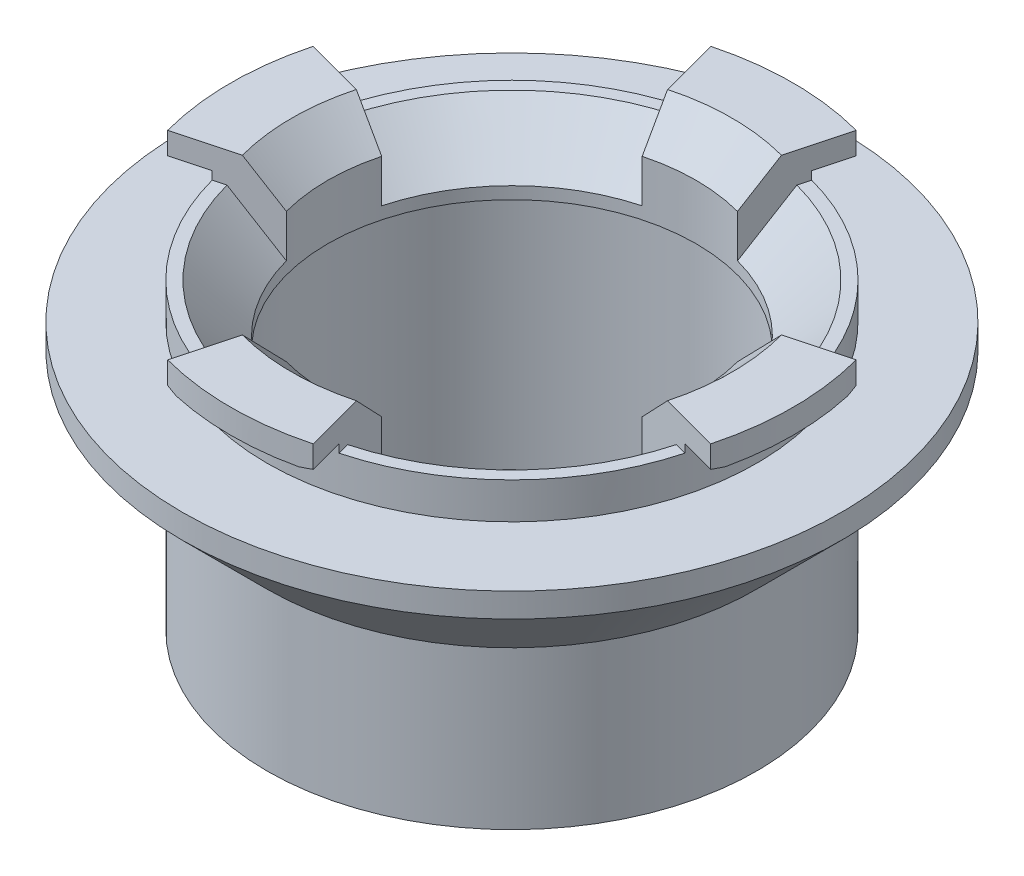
ISO-10303-21;
HEADER;
FILE_DESCRIPTION(('STEP AP214'),'2;1');
FILE_NAME('part.step','',(''),(''),'','','');
FILE_SCHEMA(('AUTOMOTIVE_DESIGN { 1 0 10303 214 1 1 1 1 }'));
ENDSEC;
DATA;
#1=APPLICATION_CONTEXT('core data for automotive mechanical design processes');
#2=APPLICATION_PROTOCOL_DEFINITION('international standard','automotive_design',2000,#1);
#3=PRODUCT_CONTEXT('',#1,'mechanical');
#4=PRODUCT('Part','Part','',(#3));
#5=PRODUCT_RELATED_PRODUCT_CATEGORY('part','',(#4));
#6=PRODUCT_DEFINITION_FORMATION('','',#4);
#7=PRODUCT_DEFINITION_CONTEXT('part definition',#1,'design');
#8=PRODUCT_DEFINITION('design','',#6,#7);
#9=PRODUCT_DEFINITION_SHAPE('','',#8);
#10=(LENGTH_UNIT() NAMED_UNIT(*) SI_UNIT(.MILLI.,.METRE.));
#11=(NAMED_UNIT(*) PLANE_ANGLE_UNIT() SI_UNIT($,.RADIAN.));
#12=(NAMED_UNIT(*) SI_UNIT($,.STERADIAN.) SOLID_ANGLE_UNIT());
#13=UNCERTAINTY_MEASURE_WITH_UNIT(LENGTH_MEASURE(1.E-05),#10,'distance_accuracy_value','');
#14=(GEOMETRIC_REPRESENTATION_CONTEXT(3) GLOBAL_UNCERTAINTY_ASSIGNED_CONTEXT((#13)) GLOBAL_UNIT_ASSIGNED_CONTEXT((#10,
#11,#12)) REPRESENTATION_CONTEXT('',''));
#15=CARTESIAN_POINT('',(0.,0.,0.));
#16=DIRECTION('',(0.,0.,1.));
#17=DIRECTION('',(1.,0.,0.));
#18=AXIS2_PLACEMENT_3D('',#15,#16,#17);
#19=CARTESIAN_POINT('',(0.,-4.,0.));
#20=DIRECTION('',(0.,1.,0.));
#21=DIRECTION('',(0.,0.,1.));
#22=AXIS2_PLACEMENT_3D('',#19,#20,#21);
#23=CONICAL_SURFACE('',#22,15.2,0.785398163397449);
#24=CARTESIAN_POINT('',(0.,0.,0.));
#25=DIRECTION('',(0.,1.,0.));
#26=DIRECTION('',(0.,0.,1.));
#27=AXIS2_PLACEMENT_3D('',#24,#25,#26);
#28=CIRCLE('',#27,19.2);
#29=CARTESIAN_POINT('',(-18.5457758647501,0.,4.96932566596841));
#30=VERTEX_POINT('',#29);
#31=CARTESIAN_POINT('',(-4.96932566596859,0.,18.5457758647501));
#32=VERTEX_POINT('',#31);
#33=EDGE_CURVE('E518',#30,#32,#28,.T.);
#34=ORIENTED_EDGE('',*,*,#33,.T.);
#35=DIRECTION('',(0.183012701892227,-0.707106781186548,-0.683012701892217));
#36=VECTOR('',#35,1.);
#37=CARTESIAN_POINT('',(-4.9693256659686,0.,18.5457758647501));
#38=LINE('',#37,#36);
#39=CARTESIAN_POINT('',(-3.93404948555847,-4.,14.6820725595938));
#40=VERTEX_POINT('',#39);
#41=EDGE_CURVE('E339',#32,#40,#38,.T.);
#42=ORIENTED_EDGE('',*,*,#41,.T.);
#43=CARTESIAN_POINT('',(0.,-4.,0.));
#44=DIRECTION('',(0.,1.,0.));
#45=DIRECTION('',(0.,0.,1.));
#46=AXIS2_PLACEMENT_3D('',#43,#44,#45);
#47=CIRCLE('',#46,15.2);
#48=CARTESIAN_POINT('',(-14.6820725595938,-4.,3.93404948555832));
#49=VERTEX_POINT('',#48);
#50=EDGE_CURVE('E523',#49,#40,#47,.T.);
#51=ORIENTED_EDGE('',*,*,#50,.F.);
#52=DIRECTION('',(0.683012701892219,-0.707106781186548,-0.18301270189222));
#53=VECTOR('',#52,1.);
#54=CARTESIAN_POINT('',(-18.5457758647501,0.,4.96932566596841));
#55=LINE('',#54,#53);
#56=EDGE_CURVE('E472',#30,#49,#55,.T.);
#57=ORIENTED_EDGE('',*,*,#56,.F.);
#58=EDGE_LOOP('',(#34,#42,#51,#57));
#59=FACE_BOUND('',#58,.T.);
#60=ADVANCED_FACE('F32',(#59),#23,.F.);
#61=CARTESIAN_POINT('',(-20.2,0.,0.));
#62=DIRECTION('',(0.,1.,0.));
#63=DIRECTION('',(0.,0.,1.));
#64=AXIS2_PLACEMENT_3D('',#61,#62,#63);
#65=PLANE('',#64);
#66=CARTESIAN_POINT('',(0.,0.,0.));
#67=DIRECTION('',(0.,1.,0.));
#68=DIRECTION('',(0.,0.,1.));
#69=AXIS2_PLACEMENT_3D('',#66,#67,#68);
#70=CIRCLE('',#69,20.2);
#71=CARTESIAN_POINT('',(-19.5117016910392,0.,5.22814471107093));
#72=VERTEX_POINT('',#71);
#73=CARTESIAN_POINT('',(-5.22814471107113,0.,19.5117016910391));
#74=VERTEX_POINT('',#73);
#75=EDGE_CURVE('E514',#72,#74,#70,.T.);
#76=ORIENTED_EDGE('',*,*,#75,.T.);
#77=DIRECTION('',(0.258819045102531,0.,-0.965925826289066));
#78=VECTOR('',#77,1.);
#79=CARTESIAN_POINT('',(-5.22814471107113,0.,19.5117016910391));
#80=LINE('',#79,#78);
#81=EDGE_CURVE('E337',#74,#32,#80,.T.);
#82=ORIENTED_EDGE('',*,*,#81,.T.);
#83=ORIENTED_EDGE('',*,*,#33,.F.);
#84=DIRECTION('',(0.965925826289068,0.,-0.258819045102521));
#85=VECTOR('',#84,1.);
#86=CARTESIAN_POINT('',(-19.5117016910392,0.,5.22814471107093));
#87=LINE('',#86,#85);
#88=EDGE_CURVE('E469',#72,#30,#87,.T.);
#89=ORIENTED_EDGE('',*,*,#88,.F.);
#90=EDGE_LOOP('',(#76,#82,#83,#89));
#91=FACE_BOUND('',#90,.T.);
#92=ADVANCED_FACE('F717',(#91),#65,.T.);
#93=DIRECTION('',(-0.183012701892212,-0.707106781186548,-0.683012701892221));
#94=VECTOR('',#93,1.);
#95=CARTESIAN_POINT('',(4.96932566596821,0.,18.5457758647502));
#96=LINE('',#95,#94);
#97=CARTESIAN_POINT('',(4.96932566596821,0.,18.5457758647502));
#98=VERTEX_POINT('',#97);
#99=CARTESIAN_POINT('',(3.93404948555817,-4.,14.6820725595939));
#100=VERTEX_POINT('',#99);
#101=EDGE_CURVE('E325',#98,#100,#96,.T.);
#102=ORIENTED_EDGE('',*,*,#101,.F.);
#103=CARTESIAN_POINT('',(18.5457758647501,0.,4.96932566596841));
#104=VERTEX_POINT('',#103);
#105=EDGE_CURVE('E522',#98,#104,#28,.T.);
#106=ORIENTED_EDGE('',*,*,#105,.T.);
#107=DIRECTION('',(-0.683012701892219,-0.707106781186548,-0.18301270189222));
#108=VECTOR('',#107,1.);
#109=CARTESIAN_POINT('',(18.5457758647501,0.,4.96932566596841));
#110=LINE('',#109,#108);
#111=CARTESIAN_POINT('',(14.6820725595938,-4.,3.93404948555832));
#112=VERTEX_POINT('',#111);
#113=EDGE_CURVE('E388',#104,#112,#110,.T.);
#114=ORIENTED_EDGE('',*,*,#113,.T.);
#115=EDGE_CURVE('E527',#100,#112,#47,.T.);
#116=ORIENTED_EDGE('',*,*,#115,.F.);
#117=EDGE_LOOP('',(#102,#106,#114,#116));
#118=FACE_BOUND('',#117,.T.);
#119=ADVANCED_FACE('F668',(#118),#23,.F.);
#120=DIRECTION('',(-0.258819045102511,0.,-0.965925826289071));
#121=VECTOR('',#120,1.);
#122=CARTESIAN_POINT('',(5.22814471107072,0.,19.5117016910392));
#123=LINE('',#122,#121);
#124=CARTESIAN_POINT('',(5.22814471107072,0.,19.5117016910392));
#125=VERTEX_POINT('',#124);
#126=EDGE_CURVE('E322',#125,#98,#123,.T.);
#127=ORIENTED_EDGE('',*,*,#126,.F.);
#128=CARTESIAN_POINT('',(19.5117016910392,0.,5.22814471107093));
#129=VERTEX_POINT('',#128);
#130=EDGE_CURVE('E517',#125,#129,#70,.T.);
#131=ORIENTED_EDGE('',*,*,#130,.T.);
#132=DIRECTION('',(-0.965925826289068,0.,-0.258819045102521));
#133=VECTOR('',#132,1.);
#134=CARTESIAN_POINT('',(19.5117016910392,0.,5.22814471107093));
#135=LINE('',#134,#133);
#136=EDGE_CURVE('E385',#129,#104,#135,.T.);
#137=ORIENTED_EDGE('',*,*,#136,.T.);
#138=ORIENTED_EDGE('',*,*,#105,.F.);
#139=EDGE_LOOP('',(#127,#131,#137,#138));
#140=FACE_BOUND('',#139,.T.);
#141=ADVANCED_FACE('F657',(#140),#65,.T.);
#142=DIRECTION('',(-0.683012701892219,-0.707106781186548,0.18301270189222));
#143=VECTOR('',#142,1.);
#144=CARTESIAN_POINT('',(18.5457758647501,0.,-4.96932566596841));
#145=LINE('',#144,#143);
#146=CARTESIAN_POINT('',(18.5457758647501,0.,-4.96932566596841));
#147=VERTEX_POINT('',#146);
#148=CARTESIAN_POINT('',(14.6820725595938,-4.,-3.93404948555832));
#149=VERTEX_POINT('',#148);
#150=EDGE_CURVE('E367',#147,#149,#145,.T.);
#151=ORIENTED_EDGE('',*,*,#150,.F.);
#152=CARTESIAN_POINT('',(4.96932566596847,0.,-18.5457758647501));
#153=VERTEX_POINT('',#152);
#154=EDGE_CURVE('E669',#147,#153,#28,.T.);
#155=ORIENTED_EDGE('',*,*,#154,.T.);
#156=DIRECTION('',(-0.183012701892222,-0.707106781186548,0.683012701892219));
#157=VECTOR('',#156,1.);
#158=CARTESIAN_POINT('',(4.96932566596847,0.,-18.5457758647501));
#159=LINE('',#158,#157);
#160=CARTESIAN_POINT('',(3.93404948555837,-4.,-14.6820725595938));
#161=VERTEX_POINT('',#160);
#162=EDGE_CURVE('E442',#153,#161,#159,.T.);
#163=ORIENTED_EDGE('',*,*,#162,.T.);
#164=EDGE_CURVE('E646',#149,#161,#47,.T.);
#165=ORIENTED_EDGE('',*,*,#164,.F.);
#166=EDGE_LOOP('',(#151,#155,#163,#165));
#167=FACE_BOUND('',#166,.T.);
#168=ADVANCED_FACE('F672',(#167),#23,.F.);
#169=DIRECTION('',(-0.965925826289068,0.,0.258819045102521));
#170=VECTOR('',#169,1.);
#171=CARTESIAN_POINT('',(19.5117016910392,0.,-5.22814471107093));
#172=LINE('',#171,#170);
#173=CARTESIAN_POINT('',(19.5117016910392,0.,-5.22814471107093));
#174=VERTEX_POINT('',#173);
#175=EDGE_CURVE('E364',#174,#147,#172,.T.);
#176=ORIENTED_EDGE('',*,*,#175,.F.);
#177=CARTESIAN_POINT('',(5.228144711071,0.,-19.5117016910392));
#178=VERTEX_POINT('',#177);
#179=EDGE_CURVE('E652',#174,#178,#70,.T.);
#180=ORIENTED_EDGE('',*,*,#179,.T.);
#181=DIRECTION('',(-0.258819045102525,0.,0.965925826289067));
#182=VECTOR('',#181,1.);
#183=CARTESIAN_POINT('',(5.228144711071,0.,-19.5117016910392));
#184=LINE('',#183,#182);
#185=EDGE_CURVE('E439',#178,#153,#184,.T.);
#186=ORIENTED_EDGE('',*,*,#185,.T.);
#187=ORIENTED_EDGE('',*,*,#154,.F.);
#188=EDGE_LOOP('',(#176,#180,#186,#187));
#189=FACE_BOUND('',#188,.T.);
#190=ADVANCED_FACE('F676',(#189),#65,.T.);
#191=DIRECTION('',(0.183012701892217,-0.707106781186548,0.68301270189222));
#192=VECTOR('',#191,1.);
#193=CARTESIAN_POINT('',(-4.96932566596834,0.,-18.5457758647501));
#194=LINE('',#193,#192);
#195=CARTESIAN_POINT('',(-4.96932566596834,0.,-18.5457758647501));
#196=VERTEX_POINT('',#195);
#197=CARTESIAN_POINT('',(-3.93404948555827,-4.,-14.6820725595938));
#198=VERTEX_POINT('',#197);
#199=EDGE_CURVE('E421',#196,#198,#194,.T.);
#200=ORIENTED_EDGE('',*,*,#199,.F.);
#201=CARTESIAN_POINT('',(-18.5457758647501,0.,-4.96932566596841));
#202=VERTEX_POINT('',#201);
#203=EDGE_CURVE('E516',#196,#202,#28,.T.);
#204=ORIENTED_EDGE('',*,*,#203,.T.);
#205=DIRECTION('',(0.683012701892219,-0.707106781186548,0.18301270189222));
#206=VECTOR('',#205,1.);
#207=CARTESIAN_POINT('',(-18.5457758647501,0.,-4.96932566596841));
#208=LINE('',#207,#206);
#209=CARTESIAN_POINT('',(-14.6820725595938,-4.,-3.93404948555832));
#210=VERTEX_POINT('',#209);
#211=EDGE_CURVE('E493',#202,#210,#208,.T.);
#212=ORIENTED_EDGE('',*,*,#211,.T.);
#213=EDGE_CURVE('E521',#198,#210,#47,.T.);
#214=ORIENTED_EDGE('',*,*,#213,.F.);
#215=EDGE_LOOP('',(#200,#204,#212,#214));
#216=FACE_BOUND('',#215,.T.);
#217=ADVANCED_FACE('F647',(#216),#23,.F.);
#218=DIRECTION('',(0.258819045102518,0.,0.965925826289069));
#219=VECTOR('',#218,1.);
#220=CARTESIAN_POINT('',(-5.22814471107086,0.,-19.5117016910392));
#221=LINE('',#220,#219);
#222=CARTESIAN_POINT('',(-5.22814471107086,0.,-19.5117016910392));
#223=VERTEX_POINT('',#222);
#224=EDGE_CURVE('E418',#223,#196,#221,.T.);
#225=ORIENTED_EDGE('',*,*,#224,.F.);
#226=CARTESIAN_POINT('',(-19.5117016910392,0.,-5.22814471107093));
#227=VERTEX_POINT('',#226);
#228=EDGE_CURVE('E513',#223,#227,#70,.T.);
#229=ORIENTED_EDGE('',*,*,#228,.T.);
#230=DIRECTION('',(0.965925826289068,0.,0.258819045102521));
#231=VECTOR('',#230,1.);
#232=CARTESIAN_POINT('',(-19.5117016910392,0.,-5.22814471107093));
#233=LINE('',#232,#231);
#234=EDGE_CURVE('E490',#227,#202,#233,.T.);
#235=ORIENTED_EDGE('',*,*,#234,.T.);
#236=ORIENTED_EDGE('',*,*,#203,.F.);
#237=EDGE_LOOP('',(#225,#229,#235,#236));
#238=FACE_BOUND('',#237,.T.);
#239=ADVANCED_FACE('F651',(#238),#65,.T.);
#240=CARTESIAN_POINT('',(-20.2,-3.,0.));
#241=DIRECTION('',(0.,1.,0.));
#242=DIRECTION('',(0.,0.,1.));
#243=AXIS2_PLACEMENT_3D('',#240,#241,#242);
#244=PLANE('',#243);
#245=CARTESIAN_POINT('',(0.,-3.,0.));
#246=DIRECTION('',(0.,1.,0.));
#247=DIRECTION('',(0.,0.,1.));
#248=AXIS2_PLACEMENT_3D('',#245,#246,#247);
#249=CIRCLE('',#248,27.2);
#250=CARTESIAN_POINT('',(0.,-3.,27.2));
#251=VERTEX_POINT('',#250);
#252=EDGE_CURVE('E545',#251,#251,#249,.T.);
#253=ORIENTED_EDGE('',*,*,#252,.T.);
#254=EDGE_LOOP('',(#253));
#255=FACE_BOUND('',#254,.T.);
#256=CARTESIAN_POINT('',(0.,-3.,0.));
#257=DIRECTION('',(0.,1.,0.));
#258=DIRECTION('',(0.,0.,1.));
#259=AXIS2_PLACEMENT_3D('',#256,#257,#258);
#260=CIRCLE('',#259,20.2);
#261=CARTESIAN_POINT('',(0.,-3.,20.2));
#262=VERTEX_POINT('',#261);
#263=EDGE_CURVE('E510',#262,#262,#260,.T.);
#264=ORIENTED_EDGE('',*,*,#263,.F.);
#265=EDGE_LOOP('',(#264));
#266=FACE_BOUND('',#265,.T.);
#267=ADVANCED_FACE('F732',(#255,#266),#244,.T.);
#268=CARTESIAN_POINT('',(0.,4.1227941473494,0.));
#269=DIRECTION('',(0.,1.,0.));
#270=DIRECTION('',(0.,0.,1.));
#271=AXIS2_PLACEMENT_3D('',#268,#269,#270);
#272=CYLINDRICAL_SURFACE('',#271,27.2);
#273=CARTESIAN_POINT('',(0.,-5.,0.));
#274=DIRECTION('',(0.,1.,0.));
#275=DIRECTION('',(0.,0.,1.));
#276=AXIS2_PLACEMENT_3D('',#273,#274,#275);
#277=CIRCLE('',#276,27.2);
#278=CARTESIAN_POINT('',(0.,-5.,27.2));
#279=VERTEX_POINT('',#278);
#280=EDGE_CURVE('E542',#279,#279,#277,.T.);
#281=ORIENTED_EDGE('',*,*,#280,.T.);
#282=EDGE_LOOP('',(#281));
#283=FACE_BOUND('',#282,.T.);
#284=ORIENTED_EDGE('',*,*,#252,.F.);
#285=EDGE_LOOP('',(#284));
#286=FACE_BOUND('',#285,.T.);
#287=ADVANCED_FACE('F1160',(#283,#286),#272,.T.);
#288=CARTESIAN_POINT('',(0.,-5.,0.));
#289=DIRECTION('',(0.,1.,0.));
#290=DIRECTION('',(0.,0.,1.));
#291=AXIS2_PLACEMENT_3D('',#288,#289,#290);
#292=CONICAL_SURFACE('',#291,27.2,0.785398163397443);
#293=CARTESIAN_POINT('',(0.,-12.0000000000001,0.));
#294=DIRECTION('',(0.,1.,0.));
#295=DIRECTION('',(0.,0.,1.));
#296=AXIS2_PLACEMENT_3D('',#293,#294,#295);
#297=CIRCLE('',#296,20.2);
#298=CARTESIAN_POINT('',(0.,-12.0000000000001,20.2));
#299=VERTEX_POINT('',#298);
#300=EDGE_CURVE('E539',#299,#299,#297,.T.);
#301=ORIENTED_EDGE('',*,*,#300,.T.);
#302=EDGE_LOOP('',(#301));
#303=FACE_BOUND('',#302,.T.);
#304=ORIENTED_EDGE('',*,*,#280,.F.);
#305=EDGE_LOOP('',(#304));
#306=FACE_BOUND('',#305,.T.);
#307=ADVANCED_FACE('F1150',(#303,#306),#292,.T.);
#308=CARTESIAN_POINT('',(0.,4.1227941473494,0.));
#309=DIRECTION('',(0.,1.,0.));
#310=DIRECTION('',(0.,0.,1.));
#311=AXIS2_PLACEMENT_3D('',#308,#309,#310);
#312=CYLINDRICAL_SURFACE('',#311,20.2);
#313=CARTESIAN_POINT('',(0.,-25.,0.));
#314=DIRECTION('',(0.,1.,0.));
#315=DIRECTION('',(0.,0.,1.));
#316=AXIS2_PLACEMENT_3D('',#313,#314,#315);
#317=CIRCLE('',#316,20.2);
#318=CARTESIAN_POINT('',(0.,-25.,20.2));
#319=VERTEX_POINT('',#318);
#320=EDGE_CURVE('E536',#319,#319,#317,.T.);
#321=ORIENTED_EDGE('',*,*,#320,.T.);
#322=EDGE_LOOP('',(#321));
#323=FACE_BOUND('',#322,.T.);
#324=ORIENTED_EDGE('',*,*,#300,.F.);
#325=EDGE_LOOP('',(#324));
#326=FACE_BOUND('',#325,.T.);
#327=ADVANCED_FACE('F1140',(#323,#326),#312,.T.);
#328=CARTESIAN_POINT('',(-16.2,-25.,0.));
#329=DIRECTION('',(0.,-1.,0.));
#330=DIRECTION('',(0.,0.,-1.));
#331=AXIS2_PLACEMENT_3D('',#328,#329,#330);
#332=PLANE('',#331);
#333=CARTESIAN_POINT('',(0.,-25.,0.));
#334=DIRECTION('',(0.,1.,0.));
#335=DIRECTION('',(0.,0.,1.));
#336=AXIS2_PLACEMENT_3D('',#333,#334,#335);
#337=CIRCLE('',#336,16.2);
#338=CARTESIAN_POINT('',(0.,-25.,16.2));
#339=VERTEX_POINT('',#338);
#340=EDGE_CURVE('E533',#339,#339,#337,.T.);
#341=ORIENTED_EDGE('',*,*,#340,.T.);
#342=EDGE_LOOP('',(#341));
#343=FACE_BOUND('',#342,.T.);
#344=ORIENTED_EDGE('',*,*,#320,.F.);
#345=EDGE_LOOP('',(#344));
#346=FACE_BOUND('',#345,.T.);
#347=ADVANCED_FACE('F1130',(#343,#346),#332,.T.);
#348=CARTESIAN_POINT('',(0.,4.1227941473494,0.));
#349=DIRECTION('',(0.,1.,0.));
#350=DIRECTION('',(0.,0.,1.));
#351=AXIS2_PLACEMENT_3D('',#348,#349,#350);
#352=CYLINDRICAL_SURFACE('',#351,16.2);
#353=CARTESIAN_POINT('',(0.,-5.,0.));
#354=DIRECTION('',(0.,1.,0.));
#355=DIRECTION('',(0.,0.,1.));
#356=AXIS2_PLACEMENT_3D('',#353,#354,#355);
#357=CIRCLE('',#356,16.2);
#358=CARTESIAN_POINT('',(0.,-5.,16.2));
#359=VERTEX_POINT('',#358);
#360=EDGE_CURVE('E530',#359,#359,#357,.T.);
#361=ORIENTED_EDGE('',*,*,#360,.T.);
#362=EDGE_LOOP('',(#361));
#363=FACE_BOUND('',#362,.T.);
#364=ORIENTED_EDGE('',*,*,#340,.F.);
#365=EDGE_LOOP('',(#364));
#366=FACE_BOUND('',#365,.T.);
#367=ADVANCED_FACE('F1120',(#363,#366),#352,.F.);
#368=CARTESIAN_POINT('',(-16.2,-5.,0.));
#369=DIRECTION('',(0.,-1.,0.));
#370=DIRECTION('',(0.,0.,-1.));
#371=AXIS2_PLACEMENT_3D('',#368,#369,#370);
#372=PLANE('',#371);
#373=CARTESIAN_POINT('',(0.,-5.,0.));
#374=DIRECTION('',(0.,1.,0.));
#375=DIRECTION('',(0.,0.,1.));
#376=AXIS2_PLACEMENT_3D('',#373,#374,#375);
#377=CIRCLE('',#376,15.2);
#378=CARTESIAN_POINT('',(0.,-5.,15.2));
#379=VERTEX_POINT('',#378);
#380=EDGE_CURVE('E526',#379,#379,#377,.T.);
#381=ORIENTED_EDGE('',*,*,#380,.T.);
#382=EDGE_LOOP('',(#381));
#383=FACE_BOUND('',#382,.T.);
#384=ORIENTED_EDGE('',*,*,#360,.F.);
#385=EDGE_LOOP('',(#384));
#386=FACE_BOUND('',#385,.T.);
#387=ADVANCED_FACE('F1084',(#383,#386),#372,.T.);
#388=CARTESIAN_POINT('',(0.,4.1227941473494,0.));
#389=DIRECTION('',(0.,1.,0.));
#390=DIRECTION('',(0.,0.,1.));
#391=AXIS2_PLACEMENT_3D('',#388,#389,#390);
#392=CYLINDRICAL_SURFACE('',#391,15.2);
#393=ORIENTED_EDGE('',*,*,#50,.T.);
#394=DIRECTION('',(0.,1.,0.));
#395=VECTOR('',#394,1.);
#396=CARTESIAN_POINT('',(-3.93404948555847,-4.,14.6820725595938));
#397=LINE('',#396,#395);
#398=CARTESIAN_POINT('',(-3.93404948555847,-0.464466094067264,14.6820725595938));
#399=VERTEX_POINT('',#398);
#400=EDGE_CURVE('E341',#40,#399,#397,.T.);
#401=ORIENTED_EDGE('',*,*,#400,.T.);
#402=CARTESIAN_POINT('',(0.,-0.464466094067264,0.));
#403=DIRECTION('',(0.,1.,0.));
#404=DIRECTION('',(1.,0.,0.));
#405=AXIS2_PLACEMENT_3D('',#402,#403,#404);
#406=CIRCLE('',#405,15.2);
#407=CARTESIAN_POINT('',(3.93404948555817,-0.464466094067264,14.6820725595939));
#408=VERTEX_POINT('',#407);
#409=EDGE_CURVE('E344',#399,#408,#406,.T.);
#410=ORIENTED_EDGE('',*,*,#409,.T.);
#411=DIRECTION('',(0.,1.,0.));
#412=VECTOR('',#411,1.);
#413=CARTESIAN_POINT('',(3.93404948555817,-4.,14.6820725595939));
#414=LINE('',#413,#412);
#415=EDGE_CURVE('E312',#100,#408,#414,.T.);
#416=ORIENTED_EDGE('',*,*,#415,.F.);
#417=ORIENTED_EDGE('',*,*,#115,.T.);
#418=DIRECTION('',(0.,1.,0.));
#419=VECTOR('',#418,1.);
#420=CARTESIAN_POINT('',(14.6820725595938,-4.,3.93404948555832));
#421=LINE('',#420,#419);
#422=CARTESIAN_POINT('',(14.6820725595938,-0.464466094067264,3.93404948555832));
#423=VERTEX_POINT('',#422);
#424=EDGE_CURVE('E391',#112,#423,#421,.T.);
#425=ORIENTED_EDGE('',*,*,#424,.T.);
#426=CARTESIAN_POINT('',(0.,-0.464466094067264,0.));
#427=DIRECTION('',(0.,1.,0.));
#428=DIRECTION('',(0.,0.,-1.));
#429=AXIS2_PLACEMENT_3D('',#426,#427,#428);
#430=CIRCLE('',#429,15.2);
#431=CARTESIAN_POINT('',(14.6820725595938,-0.464466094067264,-3.93404948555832));
#432=VERTEX_POINT('',#431);
#433=EDGE_CURVE('E394',#423,#432,#430,.T.);
#434=ORIENTED_EDGE('',*,*,#433,.T.);
#435=DIRECTION('',(0.,1.,0.));
#436=VECTOR('',#435,1.);
#437=CARTESIAN_POINT('',(14.6820725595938,-4.,-3.93404948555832));
#438=LINE('',#437,#436);
#439=EDGE_CURVE('E370',#149,#432,#438,.T.);
#440=ORIENTED_EDGE('',*,*,#439,.F.);
#441=ORIENTED_EDGE('',*,*,#164,.T.);
#442=DIRECTION('',(0.,1.,0.));
#443=VECTOR('',#442,1.);
#444=CARTESIAN_POINT('',(3.93404948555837,-4.,-14.6820725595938));
#445=LINE('',#444,#443);
#446=CARTESIAN_POINT('',(3.93404948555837,-0.464466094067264,-14.6820725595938));
#447=VERTEX_POINT('',#446);
#448=EDGE_CURVE('E445',#161,#447,#445,.T.);
#449=ORIENTED_EDGE('',*,*,#448,.T.);
#450=CARTESIAN_POINT('',(0.,-0.464466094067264,0.));
#451=DIRECTION('',(0.,1.,0.));
#452=DIRECTION('',(-1.,0.,0.));
#453=AXIS2_PLACEMENT_3D('',#450,#451,#452);
#454=CIRCLE('',#453,15.2);
#455=CARTESIAN_POINT('',(-3.93404948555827,-0.464466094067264,-14.6820725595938));
#456=VERTEX_POINT('',#455);
#457=EDGE_CURVE('E448',#447,#456,#454,.T.);
#458=ORIENTED_EDGE('',*,*,#457,.T.);
#459=DIRECTION('',(0.,1.,0.));
#460=VECTOR('',#459,1.);
#461=CARTESIAN_POINT('',(-3.93404948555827,-4.,-14.6820725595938));
#462=LINE('',#461,#460);
#463=EDGE_CURVE('E424',#198,#456,#462,.T.);
#464=ORIENTED_EDGE('',*,*,#463,.F.);
#465=ORIENTED_EDGE('',*,*,#213,.T.);
#466=DIRECTION('',(0.,1.,0.));
#467=VECTOR('',#466,1.);
#468=CARTESIAN_POINT('',(-14.6820725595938,-4.,-3.93404948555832));
#469=LINE('',#468,#467);
#470=CARTESIAN_POINT('',(-14.6820725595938,-0.464466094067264,-3.93404948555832));
#471=VERTEX_POINT('',#470);
#472=EDGE_CURVE('E496',#210,#471,#469,.T.);
#473=ORIENTED_EDGE('',*,*,#472,.T.);
#474=CARTESIAN_POINT('',(0.,-0.464466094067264,0.));
#475=DIRECTION('',(0.,1.,0.));
#476=DIRECTION('',(0.,0.,1.));
#477=AXIS2_PLACEMENT_3D('',#474,#475,#476);
#478=CIRCLE('',#477,15.2);
#479=CARTESIAN_POINT('',(-14.6820725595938,-0.464466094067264,3.93404948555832));
#480=VERTEX_POINT('',#479);
#481=EDGE_CURVE('E499',#471,#480,#478,.T.);
#482=ORIENTED_EDGE('',*,*,#481,.T.);
#483=DIRECTION('',(0.,1.,0.));
#484=VECTOR('',#483,1.);
#485=CARTESIAN_POINT('',(-14.6820725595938,-4.,3.93404948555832));
#486=LINE('',#485,#484);
#487=EDGE_CURVE('E475',#49,#480,#486,.T.);
#488=ORIENTED_EDGE('',*,*,#487,.F.);
#489=EDGE_LOOP('',(#393,#401,#410,#416,#417,#425,#434,#440,#441,#449,#458,#464,#465,#473,#482,#488));
#490=FACE_BOUND('',#489,.T.);
#491=ORIENTED_EDGE('',*,*,#380,.F.);
#492=EDGE_LOOP('',(#491));
#493=FACE_BOUND('',#492,.T.);
#494=ADVANCED_FACE('F640',(#490,#493),#392,.F.);
#495=CARTESIAN_POINT('',(0.,4.1227941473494,0.));
#496=DIRECTION('',(0.,1.,0.));
#497=DIRECTION('',(0.,0.,1.));
#498=AXIS2_PLACEMENT_3D('',#495,#496,#497);
#499=CYLINDRICAL_SURFACE('',#498,20.2);
#500=ORIENTED_EDGE('',*,*,#263,.T.);
#501=EDGE_LOOP('',(#500));
#502=FACE_BOUND('',#501,.T.);
#503=ORIENTED_EDGE('',*,*,#75,.F.);
#504=DIRECTION('',(0.,-1.,0.));
#505=VECTOR('',#504,1.);
#506=CARTESIAN_POINT('',(-19.5117016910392,0.5,5.22814471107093));
#507=LINE('',#506,#505);
#508=CARTESIAN_POINT('',(-19.5117016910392,0.676326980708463,5.22814471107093));
#509=VERTEX_POINT('',#508);
#510=EDGE_CURVE('E46',#509,#72,#507,.T.);
#511=ORIENTED_EDGE('',*,*,#510,.F.);
#512=CARTESIAN_POINT('',(0.,0.676326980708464,0.));
#513=DIRECTION('',(-0.0449434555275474,0.984807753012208,-0.167731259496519));
#514=DIRECTION('',(0.254887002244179,0.173648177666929,0.951251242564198));
#515=AXIS2_PLACEMENT_3D('',#512,#513,#514);
#516=ELLIPSE('',#515,20.511617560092,20.2);
#517=CARTESIAN_POINT('',(-19.7465970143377,0.5,4.25580854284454));
#518=VERTEX_POINT('',#517);
#519=EDGE_CURVE('E11',#509,#518,#516,.F.);
#520=ORIENTED_EDGE('',*,*,#519,.T.);
#521=CARTESIAN_POINT('',(0.,0.5,0.));
#522=DIRECTION('',(0.,1.,0.));
#523=DIRECTION('',(0.,0.,1.));
#524=AXIS2_PLACEMENT_3D('',#521,#522,#523);
#525=CIRCLE('',#524,20.2);
#526=CARTESIAN_POINT('',(-19.7465970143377,0.5,-4.25580854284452));
#527=VERTEX_POINT('',#526);
#528=EDGE_CURVE('E501',#527,#518,#525,.T.);
#529=ORIENTED_EDGE('',*,*,#528,.F.);
#530=CARTESIAN_POINT('',(0.,0.676326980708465,0.));
#531=DIRECTION('',(0.044943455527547,-0.984807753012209,-0.167731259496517));
#532=DIRECTION('',(0.254887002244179,0.173648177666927,-0.951251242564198));
#533=AXIS2_PLACEMENT_3D('',#530,#531,#532);
#534=ELLIPSE('',#533,20.511617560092,20.2);
#535=CARTESIAN_POINT('',(-19.5117016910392,0.676326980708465,-5.22814471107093));
#536=VERTEX_POINT('',#535);
#537=EDGE_CURVE('E40',#527,#536,#534,.T.);
#538=ORIENTED_EDGE('',*,*,#537,.T.);
#539=DIRECTION('',(0.,-1.,0.));
#540=VECTOR('',#539,1.);
#541=CARTESIAN_POINT('',(-19.5117016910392,0.5,-5.22814471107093));
#542=LINE('',#541,#540);
#543=EDGE_CURVE('E487',#536,#227,#542,.T.);
#544=ORIENTED_EDGE('',*,*,#543,.T.);
#545=ORIENTED_EDGE('',*,*,#228,.F.);
#546=DIRECTION('',(0.,-1.,0.));
#547=VECTOR('',#546,1.);
#548=CARTESIAN_POINT('',(-5.22814471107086,0.5,-19.5117016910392));
#549=LINE('',#548,#547);
#550=CARTESIAN_POINT('',(-5.22814471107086,0.676326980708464,-19.5117016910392));
#551=VERTEX_POINT('',#550);
#552=EDGE_CURVE('E415',#551,#223,#549,.T.);
#553=ORIENTED_EDGE('',*,*,#552,.F.);
#554=CARTESIAN_POINT('',(0.,0.676326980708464,0.));
#555=DIRECTION('',(0.167731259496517,0.984807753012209,-0.0449434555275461));
#556=DIRECTION('',(-0.951251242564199,0.173648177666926,0.254887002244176));
#557=AXIS2_PLACEMENT_3D('',#554,#555,#556);
#558=ELLIPSE('',#557,20.511617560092,20.2);
#559=CARTESIAN_POINT('',(-4.25580854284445,0.5,-19.7465970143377));
#560=VERTEX_POINT('',#559);
#561=EDGE_CURVE('E603',#551,#560,#558,.F.);
#562=ORIENTED_EDGE('',*,*,#561,.T.);
#563=CARTESIAN_POINT('',(0.,0.5,0.));
#564=DIRECTION('',(0.,1.,0.));
#565=DIRECTION('',(-1.,0.,0.));
#566=AXIS2_PLACEMENT_3D('',#563,#564,#565);
#567=CIRCLE('',#566,20.2);
#568=CARTESIAN_POINT('',(4.25580854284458,0.5,-19.7465970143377));
#569=VERTEX_POINT('',#568);
#570=EDGE_CURVE('E450',#569,#560,#567,.T.);
#571=ORIENTED_EDGE('',*,*,#570,.F.);
#572=CARTESIAN_POINT('',(0.,0.676326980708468,0.));
#573=DIRECTION('',(0.167731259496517,-0.984807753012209,0.0449434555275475));
#574=DIRECTION('',(0.951251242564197,0.173648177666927,0.254887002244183));
#575=AXIS2_PLACEMENT_3D('',#572,#573,#574);
#576=ELLIPSE('',#575,20.511617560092,20.2);
#577=CARTESIAN_POINT('',(5.228144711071,0.676326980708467,-19.5117016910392));
#578=VERTEX_POINT('',#577);
#579=EDGE_CURVE('E605',#569,#578,#576,.T.);
#580=ORIENTED_EDGE('',*,*,#579,.T.);
#581=DIRECTION('',(0.,-1.,0.));
#582=VECTOR('',#581,1.);
#583=CARTESIAN_POINT('',(5.228144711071,0.5,-19.5117016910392));
#584=LINE('',#583,#582);
#585=EDGE_CURVE('E436',#578,#178,#584,.T.);
#586=ORIENTED_EDGE('',*,*,#585,.T.);
#587=ORIENTED_EDGE('',*,*,#179,.F.);
#588=DIRECTION('',(0.,-1.,0.));
#589=VECTOR('',#588,1.);
#590=CARTESIAN_POINT('',(19.5117016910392,0.5,-5.22814471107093));
#591=LINE('',#590,#589);
#592=CARTESIAN_POINT('',(19.5117016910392,0.676326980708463,-5.22814471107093));
#593=VERTEX_POINT('',#592);
#594=EDGE_CURVE('E361',#593,#174,#591,.T.);
#595=ORIENTED_EDGE('',*,*,#594,.F.);
#596=CARTESIAN_POINT('',(0.,0.676326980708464,0.));
#597=DIRECTION('',(0.0449434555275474,0.984807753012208,0.167731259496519));
#598=DIRECTION('',(-0.254887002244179,0.173648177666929,-0.951251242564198));
#599=AXIS2_PLACEMENT_3D('',#596,#597,#598);
#600=ELLIPSE('',#599,20.511617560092,20.2);
#601=CARTESIAN_POINT('',(19.7465970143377,0.5,-4.25580854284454));
#602=VERTEX_POINT('',#601);
#603=EDGE_CURVE('E608',#593,#602,#600,.F.);
#604=ORIENTED_EDGE('',*,*,#603,.T.);
#605=CARTESIAN_POINT('',(0.,0.5,0.));
#606=DIRECTION('',(0.,1.,0.));
#607=DIRECTION('',(0.,0.,-1.));
#608=AXIS2_PLACEMENT_3D('',#605,#606,#607);
#609=CIRCLE('',#608,20.2);
#610=CARTESIAN_POINT('',(19.7465970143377,0.5,4.25580854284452));
#611=VERTEX_POINT('',#610);
#612=EDGE_CURVE('E396',#611,#602,#609,.T.);
#613=ORIENTED_EDGE('',*,*,#612,.F.);
#614=CARTESIAN_POINT('',(0.,0.676326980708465,0.));
#615=DIRECTION('',(-0.044943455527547,-0.984807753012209,0.167731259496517));
#616=DIRECTION('',(-0.254887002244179,0.173648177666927,0.951251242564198));
#617=AXIS2_PLACEMENT_3D('',#614,#615,#616);
#618=ELLIPSE('',#617,20.511617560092,20.2);
#619=CARTESIAN_POINT('',(19.5117016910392,0.676326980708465,5.22814471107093));
#620=VERTEX_POINT('',#619);
#621=EDGE_CURVE('E610',#611,#620,#618,.T.);
#622=ORIENTED_EDGE('',*,*,#621,.T.);
#623=DIRECTION('',(0.,-1.,0.));
#624=VECTOR('',#623,1.);
#625=CARTESIAN_POINT('',(19.5117016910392,0.5,5.22814471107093));
#626=LINE('',#625,#624);
#627=EDGE_CURVE('E382',#620,#129,#626,.T.);
#628=ORIENTED_EDGE('',*,*,#627,.T.);
#629=ORIENTED_EDGE('',*,*,#130,.F.);
#630=DIRECTION('',(0.,-1.,0.));
#631=VECTOR('',#630,1.);
#632=CARTESIAN_POINT('',(5.22814471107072,0.5,19.5117016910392));
#633=LINE('',#632,#631);
#634=CARTESIAN_POINT('',(5.22814471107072,0.676326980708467,19.5117016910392));
#635=VERTEX_POINT('',#634);
#636=EDGE_CURVE('E317',#635,#125,#633,.T.);
#637=ORIENTED_EDGE('',*,*,#636,.F.);
#638=CARTESIAN_POINT('',(0.,0.676326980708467,0.));
#639=DIRECTION('',(-0.16773125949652,0.984807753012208,0.0449434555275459));
#640=DIRECTION('',(0.951251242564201,0.173648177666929,-0.254887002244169));
#641=AXIS2_PLACEMENT_3D('',#638,#639,#640);
#642=ELLIPSE('',#641,20.511617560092,20.2);
#643=CARTESIAN_POINT('',(4.25580854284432,0.5,19.7465970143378));
#644=VERTEX_POINT('',#643);
#645=EDGE_CURVE('E613',#635,#644,#642,.F.);
#646=ORIENTED_EDGE('',*,*,#645,.T.);
#647=CARTESIAN_POINT('',(0.,0.5,0.));
#648=DIRECTION('',(0.,1.,0.));
#649=DIRECTION('',(1.,0.,0.));
#650=AXIS2_PLACEMENT_3D('',#647,#648,#649);
#651=CIRCLE('',#650,20.2);
#652=CARTESIAN_POINT('',(-4.25580854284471,0.5,19.7465970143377));
#653=VERTEX_POINT('',#652);
#654=EDGE_CURVE('E346',#653,#644,#651,.T.);
#655=ORIENTED_EDGE('',*,*,#654,.F.);
#656=CARTESIAN_POINT('',(0.,0.676326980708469,0.));
#657=DIRECTION('',(-0.167731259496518,-0.984807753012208,-0.044943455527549));
#658=DIRECTION('',(-0.951251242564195,0.173648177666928,-0.254887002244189));
#659=AXIS2_PLACEMENT_3D('',#656,#657,#658);
#660=ELLIPSE('',#659,20.511617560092,20.2);
#661=CARTESIAN_POINT('',(-5.22814471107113,0.676326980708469,19.5117016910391));
#662=VERTEX_POINT('',#661);
#663=EDGE_CURVE('E615',#653,#662,#660,.T.);
#664=ORIENTED_EDGE('',*,*,#663,.T.);
#665=DIRECTION('',(0.,-1.,0.));
#666=VECTOR('',#665,1.);
#667=CARTESIAN_POINT('',(-5.22814471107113,0.5,19.5117016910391));
#668=LINE('',#667,#666);
#669=EDGE_CURVE('E334',#662,#74,#668,.T.);
#670=ORIENTED_EDGE('',*,*,#669,.T.);
#671=EDGE_LOOP('',(#503,#511,#520,#529,#538,#544,#545,#553,#562,#571,#580,#586,#587,#595,#604,
#613,#622,#628,#629,#637,#646,#655,#664,#670));
#672=FACE_BOUND('',#671,.T.);
#673=ADVANCED_FACE('F620',(#502,#672),#499,.T.);
#674=CARTESIAN_POINT('',(0.,-0.464466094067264,0.));
#675=DIRECTION('',(0.,1.,0.));
#676=DIRECTION('',(0.,0.,1.));
#677=AXIS2_PLACEMENT_3D('',#674,#675,#676);
#678=CONICAL_SURFACE('',#677,15.2,0.785398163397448);
#679=CARTESIAN_POINT('',(0.,2.5,0.));
#680=DIRECTION('',(0.,1.,0.));
#681=DIRECTION('',(0.,0.,1.));
#682=AXIS2_PLACEMENT_3D('',#679,#680,#681);
#683=CIRCLE('',#682,18.1644660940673);
#684=CARTESIAN_POINT('',(-17.5455269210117,2.5,-4.70130976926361));
#685=VERTEX_POINT('',#684);
#686=CARTESIAN_POINT('',(-17.5455269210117,2.5,4.70130976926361));
#687=VERTEX_POINT('',#686);
#688=EDGE_CURVE('E508',#685,#687,#683,.T.);
#689=ORIENTED_EDGE('',*,*,#688,.T.);
#690=DIRECTION('',(-0.683012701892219,0.707106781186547,0.18301270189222));
#691=VECTOR('',#690,1.);
#692=CARTESIAN_POINT('',(-17.5455269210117,2.5,4.70130976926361));
#693=LINE('',#692,#691);
#694=EDGE_CURVE('E460',#480,#687,#693,.T.);
#695=ORIENTED_EDGE('',*,*,#694,.F.);
#696=ORIENTED_EDGE('',*,*,#481,.F.);
#697=DIRECTION('',(-0.683012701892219,0.707106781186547,-0.18301270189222));
#698=VECTOR('',#697,1.);
#699=CARTESIAN_POINT('',(-17.5455269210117,2.5,-4.70130976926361));
#700=LINE('',#699,#698);
#701=EDGE_CURVE('E478',#471,#685,#700,.T.);
#702=ORIENTED_EDGE('',*,*,#701,.T.);
#703=EDGE_LOOP('',(#689,#695,#696,#702));
#704=FACE_BOUND('',#703,.T.);
#705=ADVANCED_FACE('F742',(#704),#678,.F.);
#706=CARTESIAN_POINT('',(-22.4094791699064,2.5,-6.00460184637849));
#707=DIRECTION('',(0.,1.,0.));
#708=DIRECTION('',(0.,0.,1.));
#709=AXIS2_PLACEMENT_3D('',#706,#707,#708);
#710=PLANE('',#709);
#711=CARTESIAN_POINT('',(0.,2.5,0.));
#712=DIRECTION('',(0.,1.,0.));
#713=DIRECTION('',(0.,0.,1.));
#714=AXIS2_PLACEMENT_3D('',#711,#712,#713);
#715=CIRCLE('',#714,23.2);
#716=CARTESIAN_POINT('',(-22.4094791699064,2.5,-6.00460184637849));
#717=VERTEX_POINT('',#716);
#718=CARTESIAN_POINT('',(-22.4094791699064,2.5,6.00460184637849));
#719=VERTEX_POINT('',#718);
#720=EDGE_CURVE('E506',#717,#719,#715,.T.);
#721=ORIENTED_EDGE('',*,*,#720,.T.);
#722=DIRECTION('',(-0.965925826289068,0.,0.258819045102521));
#723=VECTOR('',#722,1.);
#724=CARTESIAN_POINT('',(-22.4094791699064,2.5,6.00460184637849));
#725=LINE('',#724,#723);
#726=EDGE_CURVE('E463',#687,#719,#725,.T.);
#727=ORIENTED_EDGE('',*,*,#726,.F.);
#728=ORIENTED_EDGE('',*,*,#688,.F.);
#729=DIRECTION('',(-0.965925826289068,0.,-0.258819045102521));
#730=VECTOR('',#729,1.);
#731=CARTESIAN_POINT('',(-22.4094791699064,2.5,-6.00460184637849));
#732=LINE('',#731,#730);
#733=EDGE_CURVE('E481',#685,#717,#732,.T.);
#734=ORIENTED_EDGE('',*,*,#733,.T.);
#735=EDGE_LOOP('',(#721,#727,#728,#734));
#736=FACE_BOUND('',#735,.T.);
#737=ADVANCED_FACE('F634',(#736),#710,.T.);
#738=CARTESIAN_POINT('',(0.,5.61928900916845,0.));
#739=DIRECTION('',(0.,1.,0.));
#740=DIRECTION('',(0.,0.,1.));
#741=AXIS2_PLACEMENT_3D('',#738,#739,#740);
#742=CYLINDRICAL_SURFACE('',#741,23.2);
#743=DIRECTION('',(0.,-1.,0.));
#744=VECTOR('',#743,1.);
#745=CARTESIAN_POINT('',(-22.4094791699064,0.5,-6.00460184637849));
#746=LINE('',#745,#744);
#747=CARTESIAN_POINT('',(-22.4094791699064,0.676326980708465,-6.00460184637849));
#748=VERTEX_POINT('',#747);
#749=EDGE_CURVE('E484',#717,#748,#746,.T.);
#750=ORIENTED_EDGE('',*,*,#749,.T.);
#751=CARTESIAN_POINT('',(0.,0.676326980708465,0.));
#752=DIRECTION('',(0.044943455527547,-0.984807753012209,-0.167731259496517));
#753=DIRECTION('',(0.254887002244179,0.173648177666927,-0.951251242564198));
#754=AXIS2_PLACEMENT_3D('',#751,#752,#753);
#755=ELLIPSE('',#754,23.5578973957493,23.2);
#756=CARTESIAN_POINT('',(-22.6474711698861,0.5,-5.03309543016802));
#757=VERTEX_POINT('',#756);
#758=EDGE_CURVE('E598',#748,#757,#755,.F.);
#759=ORIENTED_EDGE('',*,*,#758,.T.);
#760=CARTESIAN_POINT('',(0.,0.5,0.));
#761=DIRECTION('',(0.,1.,0.));
#762=DIRECTION('',(0.,0.,1.));
#763=AXIS2_PLACEMENT_3D('',#760,#761,#762);
#764=CIRCLE('',#763,23.2);
#765=CARTESIAN_POINT('',(-22.6474711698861,0.5,5.03309543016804));
#766=VERTEX_POINT('',#765);
#767=EDGE_CURVE('E504',#757,#766,#764,.T.);
#768=ORIENTED_EDGE('',*,*,#767,.T.);
#769=CARTESIAN_POINT('',(0.,0.676326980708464,0.));
#770=DIRECTION('',(-0.0449434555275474,0.984807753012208,-0.167731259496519));
#771=DIRECTION('',(0.254887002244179,0.173648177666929,0.951251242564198));
#772=AXIS2_PLACEMENT_3D('',#769,#770,#771);
#773=ELLIPSE('',#772,23.5578973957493,23.2);
#774=CARTESIAN_POINT('',(-22.4094791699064,0.676326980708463,6.00460184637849));
#775=VERTEX_POINT('',#774);
#776=EDGE_CURVE('E54',#766,#775,#773,.T.);
#777=ORIENTED_EDGE('',*,*,#776,.T.);
#778=DIRECTION('',(0.,-1.,0.));
#779=VECTOR('',#778,1.);
#780=CARTESIAN_POINT('',(-22.4094791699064,0.5,6.00460184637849));
#781=LINE('',#780,#779);
#782=EDGE_CURVE('E466',#719,#775,#781,.T.);
#783=ORIENTED_EDGE('',*,*,#782,.F.);
#784=ORIENTED_EDGE('',*,*,#720,.F.);
#785=EDGE_LOOP('',(#750,#759,#768,#777,#783,#784));
#786=FACE_BOUND('',#785,.T.);
#787=ADVANCED_FACE('F630',(#786),#742,.T.);
#788=CARTESIAN_POINT('',(-22.4094791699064,0.5,-6.00460184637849));
#789=DIRECTION('',(0.,-1.,0.));
#790=DIRECTION('',(0.,0.,-1.));
#791=AXIS2_PLACEMENT_3D('',#788,#789,#790);
#792=PLANE('',#791);
#793=ORIENTED_EDGE('',*,*,#767,.F.);
#794=DIRECTION('',(0.965925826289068,0.,0.258819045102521));
#795=VECTOR('',#794,1.);
#796=CARTESIAN_POINT('',(-19.7705207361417,0.5,-4.26221888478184));
#797=LINE('',#796,#795);
#798=EDGE_CURVE('E592',#757,#527,#797,.T.);
#799=ORIENTED_EDGE('',*,*,#798,.T.);
#800=ORIENTED_EDGE('',*,*,#528,.T.);
#801=DIRECTION('',(-0.965925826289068,0.,0.258819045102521));
#802=VECTOR('',#801,1.);
#803=CARTESIAN_POINT('',(-19.6659972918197,0.5,4.23421191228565));
#804=LINE('',#803,#802);
#805=EDGE_CURVE('E590',#518,#766,#804,.T.);
#806=ORIENTED_EDGE('',*,*,#805,.T.);
#807=EDGE_LOOP('',(#793,#799,#800,#806));
#808=FACE_BOUND('',#807,.T.);
#809=ADVANCED_FACE('F748',(#808),#792,.T.);
#810=CARTESIAN_POINT('',(0.,0.,0.));
#811=DIRECTION('',(-0.258819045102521,0.,0.965925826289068));
#812=DIRECTION('',(0.965925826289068,0.,0.258819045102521));
#813=AXIS2_PLACEMENT_3D('',#810,#811,#812);
#814=PLANE('',#813);
#815=ORIENTED_EDGE('',*,*,#543,.F.);
#816=DIRECTION('',(-0.965925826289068,0.,-0.258819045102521));
#817=VECTOR('',#816,1.);
#818=CARTESIAN_POINT('',(-22.4094791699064,0.676326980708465,-6.00460184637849));
#819=LINE('',#818,#817);
#820=EDGE_CURVE('E595',#536,#748,#819,.T.);
#821=ORIENTED_EDGE('',*,*,#820,.T.);
#822=ORIENTED_EDGE('',*,*,#749,.F.);
#823=ORIENTED_EDGE('',*,*,#733,.F.);
#824=ORIENTED_EDGE('',*,*,#701,.F.);
#825=ORIENTED_EDGE('',*,*,#472,.F.);
#826=ORIENTED_EDGE('',*,*,#211,.F.);
#827=ORIENTED_EDGE('',*,*,#234,.F.);
#828=EDGE_LOOP('',(#815,#821,#822,#823,#824,#825,#826,#827));
#829=FACE_BOUND('',#828,.T.);
#830=ADVANCED_FACE('F628',(#829),#814,.F.);
#831=CARTESIAN_POINT('',(0.,0.,0.));
#832=DIRECTION('',(0.258819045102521,0.,0.965925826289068));
#833=DIRECTION('',(0.965925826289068,0.,-0.258819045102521));
#834=AXIS2_PLACEMENT_3D('',#831,#832,#833);
#835=PLANE('',#834);
#836=ORIENTED_EDGE('',*,*,#782,.T.);
#837=DIRECTION('',(0.965925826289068,0.,-0.258819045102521));
#838=VECTOR('',#837,1.);
#839=CARTESIAN_POINT('',(0.,0.676326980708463,0.));
#840=LINE('',#839,#838);
#841=EDGE_CURVE('E600',#775,#509,#840,.T.);
#842=ORIENTED_EDGE('',*,*,#841,.T.);
#843=ORIENTED_EDGE('',*,*,#510,.T.);
#844=ORIENTED_EDGE('',*,*,#88,.T.);
#845=ORIENTED_EDGE('',*,*,#56,.T.);
#846=ORIENTED_EDGE('',*,*,#487,.T.);
#847=ORIENTED_EDGE('',*,*,#694,.T.);
#848=ORIENTED_EDGE('',*,*,#726,.T.);
#849=EDGE_LOOP('',(#836,#842,#843,#844,#845,#846,#847,#848));
#850=FACE_BOUND('',#849,.T.);
#851=ADVANCED_FACE('F756',(#850),#835,.T.);
#852=CARTESIAN_POINT('',(0.,-0.464466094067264,0.));
#853=DIRECTION('',(0.,1.,0.));
#854=DIRECTION('',(-1.,0.,0.));
#855=AXIS2_PLACEMENT_3D('',#852,#853,#854);
#856=CONICAL_SURFACE('',#855,15.2,0.785398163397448);
#857=CARTESIAN_POINT('',(0.,2.5,0.));
#858=DIRECTION('',(0.,1.,0.));
#859=DIRECTION('',(-1.,0.,0.));
#860=AXIS2_PLACEMENT_3D('',#857,#858,#859);
#861=CIRCLE('',#860,18.1644660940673);
#862=CARTESIAN_POINT('',(4.70130976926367,2.5,-17.5455269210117));
#863=VERTEX_POINT('',#862);
#864=CARTESIAN_POINT('',(-4.70130976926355,2.5,-17.5455269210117));
#865=VERTEX_POINT('',#864);
#866=EDGE_CURVE('E458',#863,#865,#861,.T.);
#867=ORIENTED_EDGE('',*,*,#866,.T.);
#868=DIRECTION('',(-0.183012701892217,0.707106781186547,-0.68301270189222));
#869=VECTOR('',#868,1.);
#870=CARTESIAN_POINT('',(-4.70130976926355,2.5,-17.5455269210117));
#871=LINE('',#870,#869);
#872=EDGE_CURVE('E406',#456,#865,#871,.T.);
#873=ORIENTED_EDGE('',*,*,#872,.F.);
#874=ORIENTED_EDGE('',*,*,#457,.F.);
#875=DIRECTION('',(0.183012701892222,0.707106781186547,-0.683012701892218));
#876=VECTOR('',#875,1.);
#877=CARTESIAN_POINT('',(4.70130976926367,2.5,-17.5455269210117));
#878=LINE('',#877,#876);
#879=EDGE_CURVE('E427',#447,#863,#878,.T.);
#880=ORIENTED_EDGE('',*,*,#879,.T.);
#881=EDGE_LOOP('',(#867,#873,#874,#880));
#882=FACE_BOUND('',#881,.T.);
#883=ADVANCED_FACE('F759',(#882),#856,.F.);
#884=CARTESIAN_POINT('',(6.00460184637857,2.5,-22.4094791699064));
#885=DIRECTION('',(0.,1.,0.));
#886=DIRECTION('',(-1.,0.,0.));
#887=AXIS2_PLACEMENT_3D('',#884,#885,#886);
#888=PLANE('',#887);
#889=CARTESIAN_POINT('',(0.,2.5,0.));
#890=DIRECTION('',(0.,1.,0.));
#891=DIRECTION('',(-1.,0.,0.));
#892=AXIS2_PLACEMENT_3D('',#889,#890,#891);
#893=CIRCLE('',#892,23.2);
#894=CARTESIAN_POINT('',(6.00460184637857,2.5,-22.4094791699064));
#895=VERTEX_POINT('',#894);
#896=CARTESIAN_POINT('',(-6.00460184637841,2.5,-22.4094791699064));
#897=VERTEX_POINT('',#896);
#898=EDGE_CURVE('E456',#895,#897,#893,.T.);
#899=ORIENTED_EDGE('',*,*,#898,.T.);
#900=DIRECTION('',(-0.258819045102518,0.,-0.965925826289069));
#901=VECTOR('',#900,1.);
#902=CARTESIAN_POINT('',(-6.00460184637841,2.5,-22.4094791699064));
#903=LINE('',#902,#901);
#904=EDGE_CURVE('E409',#865,#897,#903,.T.);
#905=ORIENTED_EDGE('',*,*,#904,.F.);
#906=ORIENTED_EDGE('',*,*,#866,.F.);
#907=DIRECTION('',(0.258819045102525,0.,-0.965925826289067));
#908=VECTOR('',#907,1.);
#909=CARTESIAN_POINT('',(6.00460184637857,2.5,-22.4094791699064));
#910=LINE('',#909,#908);
#911=EDGE_CURVE('E430',#863,#895,#910,.T.);
#912=ORIENTED_EDGE('',*,*,#911,.T.);
#913=EDGE_LOOP('',(#899,#905,#906,#912));
#914=FACE_BOUND('',#913,.T.);
#915=ADVANCED_FACE('F761',(#914),#888,.T.);
#916=CARTESIAN_POINT('',(0.,5.61928900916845,0.));
#917=DIRECTION('',(0.,1.,0.));
#918=DIRECTION('',(-1.,0.,0.));
#919=AXIS2_PLACEMENT_3D('',#916,#917,#918);
#920=CYLINDRICAL_SURFACE('',#919,23.2);
#921=CARTESIAN_POINT('',(0.,0.5,0.));
#922=DIRECTION('',(0.,1.,0.));
#923=DIRECTION('',(-1.,0.,0.));
#924=AXIS2_PLACEMENT_3D('',#921,#922,#923);
#925=CIRCLE('',#924,23.2);
#926=CARTESIAN_POINT('',(5.03309543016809,0.5,-22.6474711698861));
#927=VERTEX_POINT('',#926);
#928=CARTESIAN_POINT('',(-5.03309543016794,0.5,-22.6474711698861));
#929=VERTEX_POINT('',#928);
#930=EDGE_CURVE('E453',#927,#929,#925,.T.);
#931=ORIENTED_EDGE('',*,*,#930,.T.);
#932=CARTESIAN_POINT('',(0.,0.676326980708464,0.));
#933=DIRECTION('',(0.167731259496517,0.984807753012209,-0.0449434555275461));
#934=DIRECTION('',(-0.951251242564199,0.173648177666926,0.254887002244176));
#935=AXIS2_PLACEMENT_3D('',#932,#933,#934);
#936=ELLIPSE('',#935,23.5578973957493,23.2);
#937=CARTESIAN_POINT('',(-6.00460184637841,0.676326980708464,-22.4094791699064));
#938=VERTEX_POINT('',#937);
#939=EDGE_CURVE('E558',#929,#938,#936,.T.);
#940=ORIENTED_EDGE('',*,*,#939,.T.);
#941=DIRECTION('',(0.,-1.,0.));
#942=VECTOR('',#941,1.);
#943=CARTESIAN_POINT('',(-6.00460184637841,0.5,-22.4094791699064));
#944=LINE('',#943,#942);
#945=EDGE_CURVE('E412',#897,#938,#944,.T.);
#946=ORIENTED_EDGE('',*,*,#945,.F.);
#947=ORIENTED_EDGE('',*,*,#898,.F.);
#948=DIRECTION('',(0.,-1.,0.));
#949=VECTOR('',#948,1.);
#950=CARTESIAN_POINT('',(6.00460184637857,0.5,-22.4094791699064));
#951=LINE('',#950,#949);
#952=CARTESIAN_POINT('',(6.00460184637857,0.676326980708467,-22.4094791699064));
#953=VERTEX_POINT('',#952);
#954=EDGE_CURVE('E433',#895,#953,#951,.T.);
#955=ORIENTED_EDGE('',*,*,#954,.T.);
#956=CARTESIAN_POINT('',(0.,0.676326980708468,0.));
#957=DIRECTION('',(0.167731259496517,-0.984807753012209,0.0449434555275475));
#958=DIRECTION('',(0.951251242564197,0.173648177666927,0.254887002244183));
#959=AXIS2_PLACEMENT_3D('',#956,#957,#958);
#960=ELLIPSE('',#959,23.5578973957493,23.2);
#961=EDGE_CURVE('E556',#953,#927,#960,.F.);
#962=ORIENTED_EDGE('',*,*,#961,.T.);
#963=EDGE_LOOP('',(#931,#940,#946,#947,#955,#962));
#964=FACE_BOUND('',#963,.T.);
#965=ADVANCED_FACE('F764',(#964),#920,.T.);
#966=CARTESIAN_POINT('',(6.00460184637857,0.5,-22.4094791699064));
#967=DIRECTION('',(0.,-1.,0.));
#968=DIRECTION('',(1.,0.,0.));
#969=AXIS2_PLACEMENT_3D('',#966,#967,#968);
#970=PLANE('',#969);
#971=ORIENTED_EDGE('',*,*,#570,.T.);
#972=DIRECTION('',(-0.258819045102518,0.,-0.965925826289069));
#973=VECTOR('',#972,1.);
#974=CARTESIAN_POINT('',(-4.23421191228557,0.5,-19.6659972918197));
#975=LINE('',#974,#973);
#976=EDGE_CURVE('E554',#560,#929,#975,.T.);
#977=ORIENTED_EDGE('',*,*,#976,.T.);
#978=ORIENTED_EDGE('',*,*,#930,.F.);
#979=DIRECTION('',(-0.258819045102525,0.,0.965925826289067));
#980=VECTOR('',#979,1.);
#981=CARTESIAN_POINT('',(4.2622188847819,0.5,-19.7705207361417));
#982=LINE('',#981,#980);
#983=EDGE_CURVE('E551',#927,#569,#982,.T.);
#984=ORIENTED_EDGE('',*,*,#983,.T.);
#985=EDGE_LOOP('',(#971,#977,#978,#984));
#986=FACE_BOUND('',#985,.T.);
#987=ADVANCED_FACE('F768',(#986),#970,.T.);
#988=CARTESIAN_POINT('',(0.,0.,0.));
#989=DIRECTION('',(-0.965925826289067,0.,-0.258819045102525));
#990=DIRECTION('',(-0.258819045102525,0.,0.965925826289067));
#991=AXIS2_PLACEMENT_3D('',#988,#989,#990);
#992=PLANE('',#991);
#993=ORIENTED_EDGE('',*,*,#585,.F.);
#994=DIRECTION('',(0.258819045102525,0.,-0.965925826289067));
#995=VECTOR('',#994,1.);
#996=CARTESIAN_POINT('',(6.00460184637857,0.676326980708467,-22.4094791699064));
#997=LINE('',#996,#995);
#998=EDGE_CURVE('E560',#578,#953,#997,.T.);
#999=ORIENTED_EDGE('',*,*,#998,.T.);
#1000=ORIENTED_EDGE('',*,*,#954,.F.);
#1001=ORIENTED_EDGE('',*,*,#911,.F.);
#1002=ORIENTED_EDGE('',*,*,#879,.F.);
#1003=ORIENTED_EDGE('',*,*,#448,.F.);
#1004=ORIENTED_EDGE('',*,*,#162,.F.);
#1005=ORIENTED_EDGE('',*,*,#185,.F.);
#1006=EDGE_LOOP('',(#993,#999,#1000,#1001,#1002,#1003,#1004,#1005));
#1007=FACE_BOUND('',#1006,.T.);
#1008=ADVANCED_FACE('F678',(#1007),#992,.F.);
#1009=CARTESIAN_POINT('',(0.,0.,0.));
#1010=DIRECTION('',(-0.965925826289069,0.,0.258819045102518));
#1011=DIRECTION('',(0.258819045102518,0.,0.965925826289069));
#1012=AXIS2_PLACEMENT_3D('',#1009,#1010,#1011);
#1013=PLANE('',#1012);
#1014=ORIENTED_EDGE('',*,*,#945,.T.);
#1015=DIRECTION('',(0.258819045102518,0.,0.965925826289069));
#1016=VECTOR('',#1015,1.);
#1017=CARTESIAN_POINT('',(0.,0.676326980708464,0.));
#1018=LINE('',#1017,#1016);
#1019=EDGE_CURVE('E548',#938,#551,#1018,.T.);
#1020=ORIENTED_EDGE('',*,*,#1019,.T.);
#1021=ORIENTED_EDGE('',*,*,#552,.T.);
#1022=ORIENTED_EDGE('',*,*,#224,.T.);
#1023=ORIENTED_EDGE('',*,*,#199,.T.);
#1024=ORIENTED_EDGE('',*,*,#463,.T.);
#1025=ORIENTED_EDGE('',*,*,#872,.T.);
#1026=ORIENTED_EDGE('',*,*,#904,.T.);
#1027=EDGE_LOOP('',(#1014,#1020,#1021,#1022,#1023,#1024,#1025,#1026));
#1028=FACE_BOUND('',#1027,.T.);
#1029=ADVANCED_FACE('F778',(#1028),#1013,.T.);
#1030=CARTESIAN_POINT('',(0.,-0.464466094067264,0.));
#1031=DIRECTION('',(0.,1.,0.));
#1032=DIRECTION('',(0.,0.,-1.));
#1033=AXIS2_PLACEMENT_3D('',#1030,#1031,#1032);
#1034=CONICAL_SURFACE('',#1033,15.2,0.785398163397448);
#1035=CARTESIAN_POINT('',(0.,2.5,0.));
#1036=DIRECTION('',(0.,1.,0.));
#1037=DIRECTION('',(0.,0.,-1.));
#1038=AXIS2_PLACEMENT_3D('',#1035,#1036,#1037);
#1039=CIRCLE('',#1038,18.1644660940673);
#1040=CARTESIAN_POINT('',(17.5455269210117,2.5,4.70130976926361));
#1041=VERTEX_POINT('',#1040);
#1042=CARTESIAN_POINT('',(17.5455269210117,2.5,-4.70130976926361));
#1043=VERTEX_POINT('',#1042);
#1044=EDGE_CURVE('E404',#1041,#1043,#1039,.T.);
#1045=ORIENTED_EDGE('',*,*,#1044,.T.);
#1046=DIRECTION('',(0.683012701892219,0.707106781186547,-0.18301270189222));
#1047=VECTOR('',#1046,1.);
#1048=CARTESIAN_POINT('',(17.5455269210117,2.5,-4.70130976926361));
#1049=LINE('',#1048,#1047);
#1050=EDGE_CURVE('E301',#432,#1043,#1049,.T.);
#1051=ORIENTED_EDGE('',*,*,#1050,.F.);
#1052=ORIENTED_EDGE('',*,*,#433,.F.);
#1053=DIRECTION('',(0.683012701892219,0.707106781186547,0.18301270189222));
#1054=VECTOR('',#1053,1.);
#1055=CARTESIAN_POINT('',(17.5455269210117,2.5,4.70130976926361));
#1056=LINE('',#1055,#1054);
#1057=EDGE_CURVE('E373',#423,#1041,#1056,.T.);
#1058=ORIENTED_EDGE('',*,*,#1057,.T.);
#1059=EDGE_LOOP('',(#1045,#1051,#1052,#1058));
#1060=FACE_BOUND('',#1059,.T.);
#1061=ADVANCED_FACE('F781',(#1060),#1034,.F.);
#1062=CARTESIAN_POINT('',(22.4094791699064,2.5,6.00460184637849));
#1063=DIRECTION('',(0.,1.,0.));
#1064=DIRECTION('',(0.,0.,-1.));
#1065=AXIS2_PLACEMENT_3D('',#1062,#1063,#1064);
#1066=PLANE('',#1065);
#1067=CARTESIAN_POINT('',(0.,2.5,0.));
#1068=DIRECTION('',(0.,1.,0.));
#1069=DIRECTION('',(0.,0.,-1.));
#1070=AXIS2_PLACEMENT_3D('',#1067,#1068,#1069);
#1071=CIRCLE('',#1070,23.2);
#1072=CARTESIAN_POINT('',(22.4094791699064,2.5,6.00460184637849));
#1073=VERTEX_POINT('',#1072);
#1074=CARTESIAN_POINT('',(22.4094791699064,2.5,-6.00460184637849));
#1075=VERTEX_POINT('',#1074);
#1076=EDGE_CURVE('E402',#1073,#1075,#1071,.T.);
#1077=ORIENTED_EDGE('',*,*,#1076,.T.);
#1078=DIRECTION('',(0.965925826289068,0.,-0.258819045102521));
#1079=VECTOR('',#1078,1.);
#1080=CARTESIAN_POINT('',(22.4094791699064,2.5,-6.00460184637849));
#1081=LINE('',#1080,#1079);
#1082=EDGE_CURVE('E355',#1043,#1075,#1081,.T.);
#1083=ORIENTED_EDGE('',*,*,#1082,.F.);
#1084=ORIENTED_EDGE('',*,*,#1044,.F.);
#1085=DIRECTION('',(0.965925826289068,0.,0.258819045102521));
#1086=VECTOR('',#1085,1.);
#1087=CARTESIAN_POINT('',(22.4094791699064,2.5,6.00460184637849));
#1088=LINE('',#1087,#1086);
#1089=EDGE_CURVE('E376',#1041,#1073,#1088,.T.);
#1090=ORIENTED_EDGE('',*,*,#1089,.T.);
#1091=EDGE_LOOP('',(#1077,#1083,#1084,#1090));
#1092=FACE_BOUND('',#1091,.T.);
#1093=ADVANCED_FACE('F783',(#1092),#1066,.T.);
#1094=CARTESIAN_POINT('',(0.,5.61928900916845,0.));
#1095=DIRECTION('',(0.,1.,0.));
#1096=DIRECTION('',(0.,0.,-1.));
#1097=AXIS2_PLACEMENT_3D('',#1094,#1095,#1096);
#1098=CYLINDRICAL_SURFACE('',#1097,23.2);
#1099=CARTESIAN_POINT('',(0.,0.5,0.));
#1100=DIRECTION('',(0.,1.,0.));
#1101=DIRECTION('',(0.,0.,-1.));
#1102=AXIS2_PLACEMENT_3D('',#1099,#1100,#1101);
#1103=CIRCLE('',#1102,23.2);
#1104=CARTESIAN_POINT('',(22.6474711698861,0.5,5.03309543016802));
#1105=VERTEX_POINT('',#1104);
#1106=CARTESIAN_POINT('',(22.6474711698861,0.5,-5.03309543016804));
#1107=VERTEX_POINT('',#1106);
#1108=EDGE_CURVE('E399',#1105,#1107,#1103,.T.);
#1109=ORIENTED_EDGE('',*,*,#1108,.T.);
#1110=CARTESIAN_POINT('',(0.,0.676326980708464,0.));
#1111=DIRECTION('',(0.0449434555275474,0.984807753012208,0.167731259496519));
#1112=DIRECTION('',(-0.254887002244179,0.173648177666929,-0.951251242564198));
#1113=AXIS2_PLACEMENT_3D('',#1110,#1111,#1112);
#1114=ELLIPSE('',#1113,23.5578973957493,23.2);
#1115=CARTESIAN_POINT('',(22.4094791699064,0.676326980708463,-6.00460184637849));
#1116=VERTEX_POINT('',#1115);
#1117=EDGE_CURVE('E572',#1107,#1116,#1114,.T.);
#1118=ORIENTED_EDGE('',*,*,#1117,.T.);
#1119=DIRECTION('',(0.,-1.,0.));
#1120=VECTOR('',#1119,1.);
#1121=CARTESIAN_POINT('',(22.4094791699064,0.5,-6.00460184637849));
#1122=LINE('',#1121,#1120);
#1123=EDGE_CURVE('E358',#1075,#1116,#1122,.T.);
#1124=ORIENTED_EDGE('',*,*,#1123,.F.);
#1125=ORIENTED_EDGE('',*,*,#1076,.F.);
#1126=DIRECTION('',(0.,-1.,0.));
#1127=VECTOR('',#1126,1.);
#1128=CARTESIAN_POINT('',(22.4094791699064,0.5,6.00460184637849));
#1129=LINE('',#1128,#1127);
#1130=CARTESIAN_POINT('',(22.4094791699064,0.676326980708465,6.00460184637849));
#1131=VERTEX_POINT('',#1130);
#1132=EDGE_CURVE('E379',#1073,#1131,#1129,.T.);
#1133=ORIENTED_EDGE('',*,*,#1132,.T.);
#1134=CARTESIAN_POINT('',(0.,0.676326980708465,0.));
#1135=DIRECTION('',(-0.044943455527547,-0.984807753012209,0.167731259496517));
#1136=DIRECTION('',(-0.254887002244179,0.173648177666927,0.951251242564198));
#1137=AXIS2_PLACEMENT_3D('',#1134,#1135,#1136);
#1138=ELLIPSE('',#1137,23.5578973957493,23.2);
#1139=EDGE_CURVE('E570',#1131,#1105,#1138,.F.);
#1140=ORIENTED_EDGE('',*,*,#1139,.T.);
#1141=EDGE_LOOP('',(#1109,#1118,#1124,#1125,#1133,#1140));
#1142=FACE_BOUND('',#1141,.T.);
#1143=ADVANCED_FACE('F786',(#1142),#1098,.T.);
#1144=CARTESIAN_POINT('',(22.4094791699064,0.5,6.00460184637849));
#1145=DIRECTION('',(0.,-1.,0.));
#1146=DIRECTION('',(0.,0.,1.));
#1147=AXIS2_PLACEMENT_3D('',#1144,#1145,#1146);
#1148=PLANE('',#1147);
#1149=ORIENTED_EDGE('',*,*,#612,.T.);
#1150=DIRECTION('',(0.965925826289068,0.,-0.258819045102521));
#1151=VECTOR('',#1150,1.);
#1152=CARTESIAN_POINT('',(19.6659972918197,0.5,-4.23421191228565));
#1153=LINE('',#1152,#1151);
#1154=EDGE_CURVE('E568',#602,#1107,#1153,.T.);
#1155=ORIENTED_EDGE('',*,*,#1154,.T.);
#1156=ORIENTED_EDGE('',*,*,#1108,.F.);
#1157=DIRECTION('',(-0.965925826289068,0.,-0.258819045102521));
#1158=VECTOR('',#1157,1.);
#1159=CARTESIAN_POINT('',(19.7705207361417,0.5,4.26221888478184));
#1160=LINE('',#1159,#1158);
#1161=EDGE_CURVE('E565',#1105,#611,#1160,.T.);
#1162=ORIENTED_EDGE('',*,*,#1161,.T.);
#1163=EDGE_LOOP('',(#1149,#1155,#1156,#1162));
#1164=FACE_BOUND('',#1163,.T.);
#1165=ADVANCED_FACE('F790',(#1164),#1148,.T.);
#1166=CARTESIAN_POINT('',(0.,0.,0.));
#1167=DIRECTION('',(0.258819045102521,0.,-0.965925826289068));
#1168=DIRECTION('',(-0.965925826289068,0.,-0.258819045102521));
#1169=AXIS2_PLACEMENT_3D('',#1166,#1167,#1168);
#1170=PLANE('',#1169);
#1171=ORIENTED_EDGE('',*,*,#627,.F.);
#1172=DIRECTION('',(0.965925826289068,0.,0.258819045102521));
#1173=VECTOR('',#1172,1.);
#1174=CARTESIAN_POINT('',(22.4094791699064,0.676326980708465,6.00460184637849));
#1175=LINE('',#1174,#1173);
#1176=EDGE_CURVE('E574',#620,#1131,#1175,.T.);
#1177=ORIENTED_EDGE('',*,*,#1176,.T.);
#1178=ORIENTED_EDGE('',*,*,#1132,.F.);
#1179=ORIENTED_EDGE('',*,*,#1089,.F.);
#1180=ORIENTED_EDGE('',*,*,#1057,.F.);
#1181=ORIENTED_EDGE('',*,*,#424,.F.);
#1182=ORIENTED_EDGE('',*,*,#113,.F.);
#1183=ORIENTED_EDGE('',*,*,#136,.F.);
#1184=EDGE_LOOP('',(#1171,#1177,#1178,#1179,#1180,#1181,#1182,#1183));
#1185=FACE_BOUND('',#1184,.T.);
#1186=ADVANCED_FACE('F664',(#1185),#1170,.F.);
#1187=CARTESIAN_POINT('',(0.,0.,0.));
#1188=DIRECTION('',(-0.258819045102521,0.,-0.965925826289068));
#1189=DIRECTION('',(-0.965925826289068,0.,0.258819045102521));
#1190=AXIS2_PLACEMENT_3D('',#1187,#1188,#1189);
#1191=PLANE('',#1190);
#1192=ORIENTED_EDGE('',*,*,#1123,.T.);
#1193=DIRECTION('',(-0.965925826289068,0.,0.258819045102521));
#1194=VECTOR('',#1193,1.);
#1195=CARTESIAN_POINT('',(0.,0.676326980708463,0.));
#1196=LINE('',#1195,#1194);
#1197=EDGE_CURVE('E562',#1116,#593,#1196,.T.);
#1198=ORIENTED_EDGE('',*,*,#1197,.T.);
#1199=ORIENTED_EDGE('',*,*,#594,.T.);
#1200=ORIENTED_EDGE('',*,*,#175,.T.);
#1201=ORIENTED_EDGE('',*,*,#150,.T.);
#1202=ORIENTED_EDGE('',*,*,#439,.T.);
#1203=ORIENTED_EDGE('',*,*,#1050,.T.);
#1204=ORIENTED_EDGE('',*,*,#1082,.T.);
#1205=EDGE_LOOP('',(#1192,#1198,#1199,#1200,#1201,#1202,#1203,#1204));
#1206=FACE_BOUND('',#1205,.T.);
#1207=ADVANCED_FACE('F800',(#1206),#1191,.T.);
#1208=CARTESIAN_POINT('',(0.,-0.464466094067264,0.));
#1209=DIRECTION('',(0.,1.,0.));
#1210=DIRECTION('',(1.,0.,0.));
#1211=AXIS2_PLACEMENT_3D('',#1208,#1209,#1210);
#1212=CONICAL_SURFACE('',#1211,15.2,0.785398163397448);
#1213=CARTESIAN_POINT('',(0.,2.5,0.));
#1214=DIRECTION('',(0.,1.,0.));
#1215=DIRECTION('',(1.,0.,0.));
#1216=AXIS2_PLACEMENT_3D('',#1213,#1214,#1215);
#1217=CIRCLE('',#1216,18.1644660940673);
#1218=CARTESIAN_POINT('',(-4.70130976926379,2.5,17.5455269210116));
#1219=VERTEX_POINT('',#1218);
#1220=CARTESIAN_POINT('',(4.70130976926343,2.5,17.5455269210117));
#1221=VERTEX_POINT('',#1220);
#1222=EDGE_CURVE('E290',#1219,#1221,#1217,.T.);
#1223=ORIENTED_EDGE('',*,*,#1222,.T.);
#1224=DIRECTION('',(0.183012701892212,0.707106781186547,0.683012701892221));
#1225=VECTOR('',#1224,1.);
#1226=CARTESIAN_POINT('',(4.70130976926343,2.5,17.5455269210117));
#1227=LINE('',#1226,#1225);
#1228=EDGE_CURVE('E293',#408,#1221,#1227,.T.);
#1229=ORIENTED_EDGE('',*,*,#1228,.F.);
#1230=ORIENTED_EDGE('',*,*,#409,.F.);
#1231=DIRECTION('',(-0.183012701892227,0.707106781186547,0.683012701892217));
#1232=VECTOR('',#1231,1.);
#1233=CARTESIAN_POINT('',(-4.70130976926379,2.5,17.5455269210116));
#1234=LINE('',#1233,#1232);
#1235=EDGE_CURVE('E296',#399,#1219,#1234,.T.);
#1236=ORIENTED_EDGE('',*,*,#1235,.T.);
#1237=EDGE_LOOP('',(#1223,#1229,#1230,#1236));
#1238=FACE_BOUND('',#1237,.T.);
#1239=ADVANCED_FACE('F292',(#1238),#1212,.F.);
#1240=CARTESIAN_POINT('',(-6.00460184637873,2.5,22.4094791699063));
#1241=DIRECTION('',(0.,1.,0.));
#1242=DIRECTION('',(1.,0.,0.));
#1243=AXIS2_PLACEMENT_3D('',#1240,#1241,#1242);
#1244=PLANE('',#1243);
#1245=CARTESIAN_POINT('',(0.,2.5,0.));
#1246=DIRECTION('',(0.,1.,0.));
#1247=DIRECTION('',(1.,0.,0.));
#1248=AXIS2_PLACEMENT_3D('',#1245,#1246,#1247);
#1249=CIRCLE('',#1248,23.2);
#1250=CARTESIAN_POINT('',(-6.00460184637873,2.5,22.4094791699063));
#1251=VERTEX_POINT('',#1250);
#1252=CARTESIAN_POINT('',(6.00460184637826,2.5,22.4094791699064));
#1253=VERTEX_POINT('',#1252);
#1254=EDGE_CURVE('E302',#1251,#1253,#1249,.T.);
#1255=ORIENTED_EDGE('',*,*,#1254,.T.);
#1256=DIRECTION('',(0.258819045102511,0.,0.965925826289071));
#1257=VECTOR('',#1256,1.);
#1258=CARTESIAN_POINT('',(6.00460184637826,2.5,22.4094791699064));
#1259=LINE('',#1258,#1257);
#1260=EDGE_CURVE('E308',#1221,#1253,#1259,.T.);
#1261=ORIENTED_EDGE('',*,*,#1260,.F.);
#1262=ORIENTED_EDGE('',*,*,#1222,.F.);
#1263=DIRECTION('',(-0.258819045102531,0.,0.965925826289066));
#1264=VECTOR('',#1263,1.);
#1265=CARTESIAN_POINT('',(-6.00460184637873,2.5,22.4094791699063));
#1266=LINE('',#1265,#1264);
#1267=EDGE_CURVE('E329',#1219,#1251,#1266,.T.);
#1268=ORIENTED_EDGE('',*,*,#1267,.T.);
#1269=EDGE_LOOP('',(#1255,#1261,#1262,#1268));
#1270=FACE_BOUND('',#1269,.T.);
#1271=ADVANCED_FACE('F314',(#1270),#1244,.T.);
#1272=CARTESIAN_POINT('',(0.,5.61928900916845,0.));
#1273=DIRECTION('',(0.,1.,0.));
#1274=DIRECTION('',(1.,0.,0.));
#1275=AXIS2_PLACEMENT_3D('',#1272,#1273,#1274);
#1276=CYLINDRICAL_SURFACE('',#1275,23.2);
#1277=CARTESIAN_POINT('',(0.,0.5,0.));
#1278=DIRECTION('',(0.,1.,0.));
#1279=DIRECTION('',(1.,0.,0.));
#1280=AXIS2_PLACEMENT_3D('',#1277,#1278,#1279);
#1281=CIRCLE('',#1280,23.2);
#1282=CARTESIAN_POINT('',(-5.03309543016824,0.5,22.647471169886));
#1283=VERTEX_POINT('',#1282);
#1284=CARTESIAN_POINT('',(5.03309543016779,0.5,22.6474711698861));
#1285=VERTEX_POINT('',#1284);
#1286=EDGE_CURVE('E349',#1283,#1285,#1281,.T.);
#1287=ORIENTED_EDGE('',*,*,#1286,.T.);
#1288=CARTESIAN_POINT('',(0.,0.676326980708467,0.));
#1289=DIRECTION('',(-0.16773125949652,0.984807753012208,0.0449434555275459));
#1290=DIRECTION('',(0.951251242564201,0.173648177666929,-0.254887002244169));
#1291=AXIS2_PLACEMENT_3D('',#1288,#1289,#1290);
#1292=ELLIPSE('',#1291,23.5578973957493,23.2);
#1293=CARTESIAN_POINT('',(6.00460184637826,0.676326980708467,22.4094791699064));
#1294=VERTEX_POINT('',#1293);
#1295=EDGE_CURVE('E586',#1285,#1294,#1292,.T.);
#1296=ORIENTED_EDGE('',*,*,#1295,.T.);
#1297=DIRECTION('',(0.,-1.,0.));
#1298=VECTOR('',#1297,1.);
#1299=CARTESIAN_POINT('',(6.00460184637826,0.5,22.4094791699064));
#1300=LINE('',#1299,#1298);
#1301=EDGE_CURVE('E315',#1253,#1294,#1300,.T.);
#1302=ORIENTED_EDGE('',*,*,#1301,.F.);
#1303=ORIENTED_EDGE('',*,*,#1254,.F.);
#1304=DIRECTION('',(0.,-1.,0.));
#1305=VECTOR('',#1304,1.);
#1306=CARTESIAN_POINT('',(-6.00460184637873,0.5,22.4094791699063));
#1307=LINE('',#1306,#1305);
#1308=CARTESIAN_POINT('',(-6.00460184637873,0.676326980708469,22.4094791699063));
#1309=VERTEX_POINT('',#1308);
#1310=EDGE_CURVE('E331',#1251,#1309,#1307,.T.);
#1311=ORIENTED_EDGE('',*,*,#1310,.T.);
#1312=CARTESIAN_POINT('',(0.,0.676326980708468,0.));
#1313=DIRECTION('',(-0.167731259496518,-0.984807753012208,-0.044943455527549));
#1314=DIRECTION('',(-0.951251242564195,0.173648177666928,-0.254887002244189));
#1315=AXIS2_PLACEMENT_3D('',#1312,#1313,#1314);
#1316=ELLIPSE('',#1315,23.5578973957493,23.2);
#1317=EDGE_CURVE('E584',#1309,#1283,#1316,.F.);
#1318=ORIENTED_EDGE('',*,*,#1317,.T.);
#1319=EDGE_LOOP('',(#1287,#1296,#1302,#1303,#1311,#1318));
#1320=FACE_BOUND('',#1319,.T.);
#1321=ADVANCED_FACE('F691',(#1320),#1276,.T.);
#1322=CARTESIAN_POINT('',(-6.00460184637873,0.5,22.4094791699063));
#1323=DIRECTION('',(0.,-1.,0.));
#1324=DIRECTION('',(-1.,0.,0.));
#1325=AXIS2_PLACEMENT_3D('',#1322,#1323,#1324);
#1326=PLANE('',#1325);
#1327=ORIENTED_EDGE('',*,*,#654,.T.);
#1328=DIRECTION('',(0.258819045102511,0.,0.965925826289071));
#1329=VECTOR('',#1328,1.);
#1330=CARTESIAN_POINT('',(4.23421191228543,0.5,19.6659972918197));
#1331=LINE('',#1330,#1329);
#1332=EDGE_CURVE('E582',#644,#1285,#1331,.T.);
#1333=ORIENTED_EDGE('',*,*,#1332,.T.);
#1334=ORIENTED_EDGE('',*,*,#1286,.F.);
#1335=DIRECTION('',(0.258819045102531,0.,-0.965925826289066));
#1336=VECTOR('',#1335,1.);
#1337=CARTESIAN_POINT('',(-4.26221888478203,0.5,19.7705207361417));
#1338=LINE('',#1337,#1336);
#1339=EDGE_CURVE('E579',#1283,#653,#1338,.T.);
#1340=ORIENTED_EDGE('',*,*,#1339,.T.);
#1341=EDGE_LOOP('',(#1327,#1333,#1334,#1340));
#1342=FACE_BOUND('',#1341,.T.);
#1343=ADVANCED_FACE('F698',(#1342),#1326,.T.);
#1344=CARTESIAN_POINT('',(0.,0.,0.));
#1345=DIRECTION('',(0.965925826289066,0.,0.258819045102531));
#1346=DIRECTION('',(0.258819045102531,0.,-0.965925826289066));
#1347=AXIS2_PLACEMENT_3D('',#1344,#1345,#1346);
#1348=PLANE('',#1347);
#1349=ORIENTED_EDGE('',*,*,#669,.F.);
#1350=DIRECTION('',(-0.258819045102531,0.,0.965925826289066));
#1351=VECTOR('',#1350,1.);
#1352=CARTESIAN_POINT('',(-6.00460184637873,0.676326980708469,22.4094791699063));
#1353=LINE('',#1352,#1351);
#1354=EDGE_CURVE('E588',#662,#1309,#1353,.T.);
#1355=ORIENTED_EDGE('',*,*,#1354,.T.);
#1356=ORIENTED_EDGE('',*,*,#1310,.F.);
#1357=ORIENTED_EDGE('',*,*,#1267,.F.);
#1358=ORIENTED_EDGE('',*,*,#1235,.F.);
#1359=ORIENTED_EDGE('',*,*,#400,.F.);
#1360=ORIENTED_EDGE('',*,*,#41,.F.);
#1361=ORIENTED_EDGE('',*,*,#81,.F.);
#1362=EDGE_LOOP('',(#1349,#1355,#1356,#1357,#1358,#1359,#1360,#1361));
#1363=FACE_BOUND('',#1362,.T.);
#1364=ADVANCED_FACE('F685',(#1363),#1348,.F.);
#1365=CARTESIAN_POINT('',(0.,0.,0.));
#1366=DIRECTION('',(0.965925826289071,0.,-0.258819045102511));
#1367=DIRECTION('',(-0.258819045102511,0.,-0.965925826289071));
#1368=AXIS2_PLACEMENT_3D('',#1365,#1366,#1367);
#1369=PLANE('',#1368);
#1370=ORIENTED_EDGE('',*,*,#1301,.T.);
#1371=DIRECTION('',(-0.258819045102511,0.,-0.965925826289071));
#1372=VECTOR('',#1371,1.);
#1373=CARTESIAN_POINT('',(0.,0.676326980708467,0.));
#1374=LINE('',#1373,#1372);
#1375=EDGE_CURVE('E576',#1294,#635,#1374,.T.);
#1376=ORIENTED_EDGE('',*,*,#1375,.T.);
#1377=ORIENTED_EDGE('',*,*,#636,.T.);
#1378=ORIENTED_EDGE('',*,*,#126,.T.);
#1379=ORIENTED_EDGE('',*,*,#101,.T.);
#1380=ORIENTED_EDGE('',*,*,#415,.T.);
#1381=ORIENTED_EDGE('',*,*,#1228,.T.);
#1382=ORIENTED_EDGE('',*,*,#1260,.T.);
#1383=EDGE_LOOP('',(#1370,#1376,#1377,#1378,#1379,#1380,#1381,#1382));
#1384=FACE_BOUND('',#1383,.T.);
#1385=ADVANCED_FACE('F307',(#1384),#1369,.T.);
#1386=CARTESIAN_POINT('',(0.,0.676326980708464,0.));
#1387=DIRECTION('',(0.167731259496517,0.984807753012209,-0.0449434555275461));
#1388=DIRECTION('',(0.258819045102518,0.,0.965925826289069));
#1389=AXIS2_PLACEMENT_3D('',#1386,#1387,#1388);
#1390=PLANE('',#1389);
#1391=ORIENTED_EDGE('',*,*,#939,.F.);
#1392=ORIENTED_EDGE('',*,*,#976,.F.);
#1393=ORIENTED_EDGE('',*,*,#561,.F.);
#1394=ORIENTED_EDGE('',*,*,#1019,.F.);
#1395=EDGE_LOOP('',(#1391,#1392,#1393,#1394));
#1396=FACE_BOUND('',#1395,.T.);
#1397=ADVANCED_FACE('F815',(#1396),#1390,.F.);
#1398=CARTESIAN_POINT('',(5.03867602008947,0.5,-22.6682982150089));
#1399=DIRECTION('',(0.167731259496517,-0.984807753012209,0.0449434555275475));
#1400=DIRECTION('',(0.258819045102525,0.,-0.965925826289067));
#1401=AXIS2_PLACEMENT_3D('',#1398,#1399,#1400);
#1402=PLANE('',#1401);
#1403=ORIENTED_EDGE('',*,*,#961,.F.);
#1404=ORIENTED_EDGE('',*,*,#998,.F.);
#1405=ORIENTED_EDGE('',*,*,#579,.F.);
#1406=ORIENTED_EDGE('',*,*,#983,.F.);
#1407=EDGE_LOOP('',(#1403,#1404,#1405,#1406));
#1408=FACE_BOUND('',#1407,.T.);
#1409=ADVANCED_FACE('F819',(#1408),#1402,.T.);
#1410=CARTESIAN_POINT('',(0.,0.676326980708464,0.));
#1411=DIRECTION('',(0.0449434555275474,0.984807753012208,0.167731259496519));
#1412=DIRECTION('',(-0.965925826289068,0.,0.258819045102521));
#1413=AXIS2_PLACEMENT_3D('',#1410,#1411,#1412);
#1414=PLANE('',#1413);
#1415=ORIENTED_EDGE('',*,*,#1117,.F.);
#1416=ORIENTED_EDGE('',*,*,#1154,.F.);
#1417=ORIENTED_EDGE('',*,*,#603,.F.);
#1418=ORIENTED_EDGE('',*,*,#1197,.F.);
#1419=EDGE_LOOP('',(#1415,#1416,#1417,#1418));
#1420=FACE_BOUND('',#1419,.T.);
#1421=ADVANCED_FACE('F713',(#1420),#1414,.F.);
#1422=CARTESIAN_POINT('',(22.6682982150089,0.5,5.0386760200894));
#1423=DIRECTION('',(-0.044943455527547,-0.984807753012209,0.167731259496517));
#1424=DIRECTION('',(0.965925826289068,0.,0.258819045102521));
#1425=AXIS2_PLACEMENT_3D('',#1422,#1423,#1424);
#1426=PLANE('',#1425);
#1427=ORIENTED_EDGE('',*,*,#1139,.F.);
#1428=ORIENTED_EDGE('',*,*,#1176,.F.);
#1429=ORIENTED_EDGE('',*,*,#621,.F.);
#1430=ORIENTED_EDGE('',*,*,#1161,.F.);
#1431=EDGE_LOOP('',(#1427,#1428,#1429,#1430));
#1432=FACE_BOUND('',#1431,.T.);
#1433=ADVANCED_FACE('F706',(#1432),#1426,.T.);
#1434=CARTESIAN_POINT('',(0.,0.676326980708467,0.));
#1435=DIRECTION('',(-0.16773125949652,0.984807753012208,0.0449434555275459));
#1436=DIRECTION('',(-0.258819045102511,0.,-0.965925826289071));
#1437=AXIS2_PLACEMENT_3D('',#1434,#1435,#1436);
#1438=PLANE('',#1437);
#1439=ORIENTED_EDGE('',*,*,#1295,.F.);
#1440=ORIENTED_EDGE('',*,*,#1332,.F.);
#1441=ORIENTED_EDGE('',*,*,#645,.F.);
#1442=ORIENTED_EDGE('',*,*,#1375,.F.);
#1443=EDGE_LOOP('',(#1439,#1440,#1441,#1442));
#1444=FACE_BOUND('',#1443,.T.);
#1445=ADVANCED_FACE('F704',(#1444),#1438,.F.);
#1446=CARTESIAN_POINT('',(-5.03867602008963,0.5,22.6682982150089));
#1447=DIRECTION('',(-0.167731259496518,-0.984807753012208,-0.044943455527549));
#1448=DIRECTION('',(-0.258819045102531,0.,0.965925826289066));
#1449=AXIS2_PLACEMENT_3D('',#1446,#1447,#1448);
#1450=PLANE('',#1449);
#1451=ORIENTED_EDGE('',*,*,#1317,.F.);
#1452=ORIENTED_EDGE('',*,*,#1354,.F.);
#1453=ORIENTED_EDGE('',*,*,#663,.F.);
#1454=ORIENTED_EDGE('',*,*,#1339,.F.);
#1455=EDGE_LOOP('',(#1451,#1452,#1453,#1454));
#1456=FACE_BOUND('',#1455,.T.);
#1457=ADVANCED_FACE('F695',(#1456),#1450,.T.);
#1458=CARTESIAN_POINT('',(-22.6682982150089,0.5,-5.0386760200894));
#1459=DIRECTION('',(0.044943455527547,-0.984807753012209,-0.167731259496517));
#1460=DIRECTION('',(-0.965925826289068,0.,-0.258819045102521));
#1461=AXIS2_PLACEMENT_3D('',#1458,#1459,#1460);
#1462=PLANE('',#1461);
#1463=ORIENTED_EDGE('',*,*,#758,.F.);
#1464=ORIENTED_EDGE('',*,*,#820,.F.);
#1465=ORIENTED_EDGE('',*,*,#537,.F.);
#1466=ORIENTED_EDGE('',*,*,#798,.F.);
#1467=EDGE_LOOP('',(#1463,#1464,#1465,#1466));
#1468=FACE_BOUND('',#1467,.T.);
#1469=ADVANCED_FACE('F625',(#1468),#1462,.T.);
#1470=CARTESIAN_POINT('',(0.,0.676326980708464,0.));
#1471=DIRECTION('',(-0.0449434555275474,0.984807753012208,-0.167731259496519));
#1472=DIRECTION('',(0.965925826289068,0.,-0.258819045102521));
#1473=AXIS2_PLACEMENT_3D('',#1470,#1471,#1472);
#1474=PLANE('',#1473);
#1475=ORIENTED_EDGE('',*,*,#776,.F.);
#1476=ORIENTED_EDGE('',*,*,#805,.F.);
#1477=ORIENTED_EDGE('',*,*,#519,.F.);
#1478=ORIENTED_EDGE('',*,*,#841,.F.);
#1479=EDGE_LOOP('',(#1475,#1476,#1477,#1478));
#1480=FACE_BOUND('',#1479,.T.);
#1481=ADVANCED_FACE('F34',(#1480),#1474,.F.);
#1482=CLOSED_SHELL('',(#60,#92,#119,#141,#168,#190,#217,#239,#267,#287,#307,#327,#347,#367,#387,
#494,#673,#705,#737,#787,#809,#830,#851,#883,#915,#965,#987,#1008,#1029,#1061,#1093,#1143,#1165,
#1186,#1207,#1239,#1271,#1321,#1343,#1364,#1385,#1397,#1409,#1421,#1433,#1445,#1457,#1469,#1481));
#1483=MANIFOLD_SOLID_BREP('B2',#1482);
#1484=ADVANCED_BREP_SHAPE_REPRESENTATION('',(#18,#1483),#14);
#1485=SHAPE_DEFINITION_REPRESENTATION(#9,#1484);
ENDSEC;
END-ISO-10303-21;
